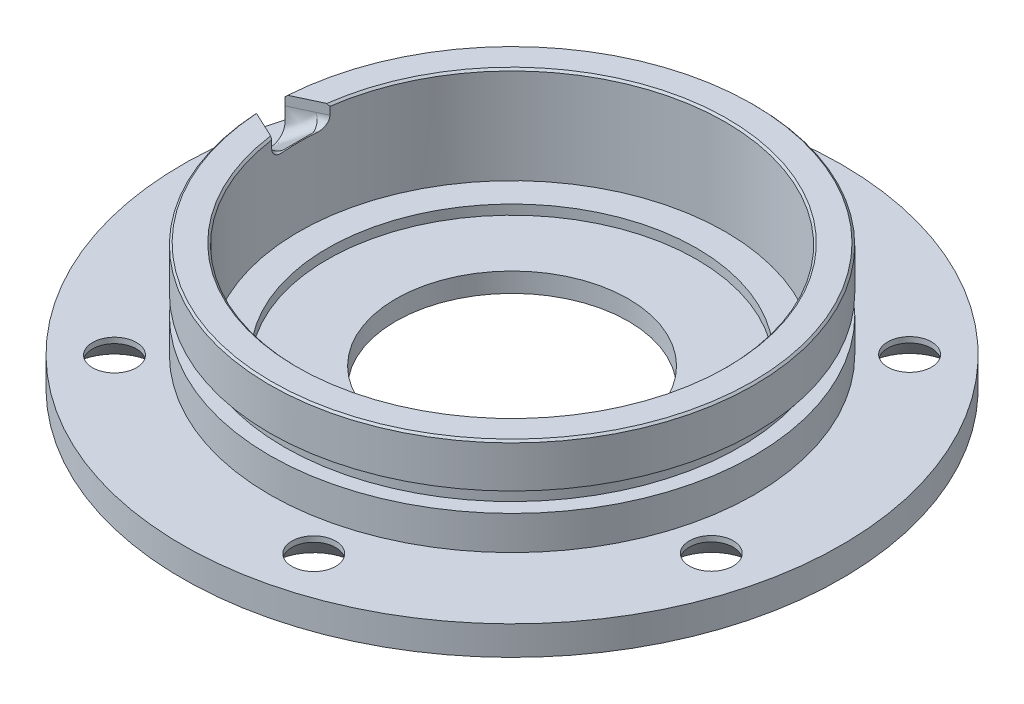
ISO-10303-21;
HEADER;
FILE_DESCRIPTION(('STEP AP214'),'2;1');
FILE_NAME('part.step','',(''),(''),'','','');
FILE_SCHEMA(('AUTOMOTIVE_DESIGN { 1 0 10303 214 1 1 1 1 }'));
ENDSEC;
DATA;
#1=APPLICATION_CONTEXT('core data for automotive mechanical design processes');
#2=APPLICATION_PROTOCOL_DEFINITION('international standard','automotive_design',2000,#1);
#3=PRODUCT_CONTEXT('',#1,'mechanical');
#4=PRODUCT('Part','Part','',(#3));
#5=PRODUCT_RELATED_PRODUCT_CATEGORY('part','',(#4));
#6=PRODUCT_DEFINITION_FORMATION('','',#4);
#7=PRODUCT_DEFINITION_CONTEXT('part definition',#1,'design');
#8=PRODUCT_DEFINITION('design','',#6,#7);
#9=PRODUCT_DEFINITION_SHAPE('','',#8);
#10=(LENGTH_UNIT() NAMED_UNIT(*) SI_UNIT(.MILLI.,.METRE.));
#11=(NAMED_UNIT(*) PLANE_ANGLE_UNIT() SI_UNIT($,.RADIAN.));
#12=(NAMED_UNIT(*) SI_UNIT($,.STERADIAN.) SOLID_ANGLE_UNIT());
#13=UNCERTAINTY_MEASURE_WITH_UNIT(LENGTH_MEASURE(1.E-05),#10,'distance_accuracy_value','');
#14=(GEOMETRIC_REPRESENTATION_CONTEXT(3) GLOBAL_UNCERTAINTY_ASSIGNED_CONTEXT((#13)) GLOBAL_UNIT_ASSIGNED_CONTEXT((#10,
#11,#12)) REPRESENTATION_CONTEXT('',''));
#15=CARTESIAN_POINT('',(0.,0.,0.));
#16=DIRECTION('',(0.,0.,1.));
#17=DIRECTION('',(1.,0.,0.));
#18=AXIS2_PLACEMENT_3D('',#15,#16,#17);
#19=CARTESIAN_POINT('',(-17.,-6.5,0.));
#20=DIRECTION('',(0.,1.,0.));
#21=DIRECTION('',(0.,0.,1.));
#22=AXIS2_PLACEMENT_3D('',#19,#20,#21);
#23=PLANE('',#22);
#24=CARTESIAN_POINT('',(3.77141398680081,-6.5,14.0009441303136));
#25=DIRECTION('',(0.,-1.,0.));
#26=DIRECTION('',(0.,0.,-1.));
#27=AXIS2_PLACEMENT_3D('',#24,#25,#26);
#28=CIRCLE('',#27,2.1844);
#29=CARTESIAN_POINT('',(3.77141398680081,-6.5,11.8165441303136));
#30=VERTEX_POINT('',#29);
#31=EDGE_CURVE('E850',#30,#30,#28,.T.);
#32=ORIENTED_EDGE('',*,*,#31,.F.);
#33=EDGE_LOOP('',(#32));
#34=FACE_BOUND('',#33,.T.);
#35=CARTESIAN_POINT('',(-14.0108802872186,-6.5,-3.73433174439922));
#36=DIRECTION('',(0.,-1.,0.));
#37=DIRECTION('',(0.,0.,-1.));
#38=AXIS2_PLACEMENT_3D('',#35,#36,#37);
#39=CIRCLE('',#38,2.1844);
#40=CARTESIAN_POINT('',(-14.0108802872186,-6.5,-5.91873174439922));
#41=VERTEX_POINT('',#40);
#42=EDGE_CURVE('E521',#41,#41,#39,.T.);
#43=ORIENTED_EDGE('',*,*,#42,.F.);
#44=EDGE_LOOP('',(#43));
#45=FACE_BOUND('',#44,.T.);
#46=CARTESIAN_POINT('',(-10.2394663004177,-6.5,10.2666123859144));
#47=DIRECTION('',(0.,-1.,0.));
#48=DIRECTION('',(0.,0.,-1.));
#49=AXIS2_PLACEMENT_3D('',#46,#47,#48);
#50=CIRCLE('',#49,2.1844);
#51=CARTESIAN_POINT('',(-10.2394663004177,-6.5,8.08221238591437));
#52=VERTEX_POINT('',#51);
#53=EDGE_CURVE('E528',#52,#52,#50,.T.);
#54=ORIENTED_EDGE('',*,*,#53,.F.);
#55=EDGE_LOOP('',(#54));
#56=FACE_BOUND('',#55,.T.);
#57=CARTESIAN_POINT('',(0.,-6.5,0.));
#58=DIRECTION('',(0.,-1.,0.));
#59=DIRECTION('',(0.,0.,-1.));
#60=AXIS2_PLACEMENT_3D('',#57,#58,#59);
#61=CIRCLE('',#60,6.);
#62=CARTESIAN_POINT('',(0.,-6.5,-6.));
#63=VERTEX_POINT('',#62);
#64=EDGE_CURVE('E453',#63,#63,#61,.T.);
#65=ORIENTED_EDGE('',*,*,#64,.F.);
#66=EDGE_LOOP('',(#65));
#67=FACE_BOUND('',#66,.T.);
#68=CARTESIAN_POINT('',(0.,-6.5,0.));
#69=DIRECTION('',(0.,-1.,0.));
#70=DIRECTION('',(0.,0.,-1.));
#71=AXIS2_PLACEMENT_3D('',#68,#69,#70);
#72=CIRCLE('',#71,17.);
#73=CARTESIAN_POINT('',(0.,-6.5,-17.));
#74=VERTEX_POINT('',#73);
#75=EDGE_CURVE('E450',#74,#74,#72,.T.);
#76=ORIENTED_EDGE('',*,*,#75,.T.);
#77=EDGE_LOOP('',(#76));
#78=FACE_BOUND('',#77,.T.);
#79=CARTESIAN_POINT('',(-3.77141398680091,-6.5,-14.0009441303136));
#80=DIRECTION('',(0.,-1.,0.));
#81=DIRECTION('',(0.,0.,-1.));
#82=AXIS2_PLACEMENT_3D('',#79,#80,#81);
#83=CIRCLE('',#82,2.1844);
#84=CARTESIAN_POINT('',(-3.77141398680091,-6.5,-16.1853441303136));
#85=VERTEX_POINT('',#84);
#86=EDGE_CURVE('E492',#85,#85,#83,.T.);
#87=ORIENTED_EDGE('',*,*,#86,.F.);
#88=EDGE_LOOP('',(#87));
#89=FACE_BOUND('',#88,.T.);
#90=CARTESIAN_POINT('',(10.2394663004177,-6.5,-10.2666123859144));
#91=DIRECTION('',(0.,-1.,0.));
#92=DIRECTION('',(0.,0.,-1.));
#93=AXIS2_PLACEMENT_3D('',#90,#91,#92);
#94=CIRCLE('',#93,2.1844);
#95=CARTESIAN_POINT('',(10.2394663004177,-6.5,-12.4510123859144));
#96=VERTEX_POINT('',#95);
#97=EDGE_CURVE('E496',#96,#96,#94,.T.);
#98=ORIENTED_EDGE('',*,*,#97,.F.);
#99=EDGE_LOOP('',(#98));
#100=FACE_BOUND('',#99,.T.);
#101=CARTESIAN_POINT('',(14.0108802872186,-6.5,3.73433174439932));
#102=DIRECTION('',(0.,-1.,0.));
#103=DIRECTION('',(0.,0.,-1.));
#104=AXIS2_PLACEMENT_3D('',#101,#102,#103);
#105=CIRCLE('',#104,2.1844);
#106=CARTESIAN_POINT('',(14.0108802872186,-6.5,1.54993174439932));
#107=VERTEX_POINT('',#106);
#108=EDGE_CURVE('E499',#107,#107,#105,.T.);
#109=ORIENTED_EDGE('',*,*,#108,.F.);
#110=EDGE_LOOP('',(#109));
#111=FACE_BOUND('',#110,.T.);
#112=ADVANCED_FACE('F123',(#34,#45,#56,#67,#78,#89,#100,#111),#23,.F.);
#113=CARTESIAN_POINT('',(-11.,-5.,0.));
#114=DIRECTION('',(0.,-1.,0.));
#115=DIRECTION('',(0.,0.,-1.));
#116=AXIS2_PLACEMENT_3D('',#113,#114,#115);
#117=PLANE('',#116);
#118=CARTESIAN_POINT('',(0.,-5.,0.));
#119=DIRECTION('',(0.,-1.,0.));
#120=DIRECTION('',(0.,0.,-1.));
#121=AXIS2_PLACEMENT_3D('',#118,#119,#120);
#122=CIRCLE('',#121,11.);
#123=CARTESIAN_POINT('',(0.,-5.,-11.));
#124=VERTEX_POINT('',#123);
#125=EDGE_CURVE('E429',#124,#124,#122,.T.);
#126=ORIENTED_EDGE('',*,*,#125,.F.);
#127=EDGE_LOOP('',(#126));
#128=FACE_BOUND('',#127,.T.);
#129=CARTESIAN_POINT('',(0.,-5.,0.));
#130=DIRECTION('',(0.,-1.,0.));
#131=DIRECTION('',(0.,0.,-1.));
#132=AXIS2_PLACEMENT_3D('',#129,#130,#131);
#133=CIRCLE('',#132,9.525);
#134=CARTESIAN_POINT('',(0.,-5.,-9.525));
#135=VERTEX_POINT('',#134);
#136=EDGE_CURVE('E347',#135,#135,#133,.T.);
#137=ORIENTED_EDGE('',*,*,#136,.T.);
#138=EDGE_LOOP('',(#137));
#139=FACE_BOUND('',#138,.T.);
#140=ADVANCED_FACE('F368',(#128,#139),#117,.F.);
#141=CARTESIAN_POINT('',(0.,0.,0.));
#142=DIRECTION('',(0.,-1.,0.));
#143=DIRECTION('',(0.,0.,-1.));
#144=AXIS2_PLACEMENT_3D('',#141,#142,#143);
#145=CYLINDRICAL_SURFACE('',#144,9.525);
#146=ORIENTED_EDGE('',*,*,#136,.F.);
#147=EDGE_LOOP('',(#146));
#148=FACE_BOUND('',#147,.T.);
#149=CARTESIAN_POINT('',(0.,-5.5,0.));
#150=DIRECTION('',(0.,-1.,0.));
#151=DIRECTION('',(0.,0.,-1.));
#152=AXIS2_PLACEMENT_3D('',#149,#150,#151);
#153=CIRCLE('',#152,9.525);
#154=CARTESIAN_POINT('',(0.,-5.5,-9.525));
#155=VERTEX_POINT('',#154);
#156=EDGE_CURVE('E459',#155,#155,#153,.T.);
#157=ORIENTED_EDGE('',*,*,#156,.T.);
#158=EDGE_LOOP('',(#157));
#159=FACE_BOUND('',#158,.T.);
#160=ADVANCED_FACE('F465',(#148,#159),#145,.F.);
#161=CARTESIAN_POINT('',(-9.525,-5.5,0.));
#162=DIRECTION('',(0.,-1.,0.));
#163=DIRECTION('',(0.,0.,-1.));
#164=AXIS2_PLACEMENT_3D('',#161,#162,#163);
#165=PLANE('',#164);
#166=ORIENTED_EDGE('',*,*,#156,.F.);
#167=EDGE_LOOP('',(#166));
#168=FACE_BOUND('',#167,.T.);
#169=CARTESIAN_POINT('',(0.,-5.5,0.));
#170=DIRECTION('',(0.,-1.,0.));
#171=DIRECTION('',(0.,0.,-1.));
#172=AXIS2_PLACEMENT_3D('',#169,#170,#171);
#173=CIRCLE('',#172,6.);
#174=CARTESIAN_POINT('',(0.,-5.5,-6.));
#175=VERTEX_POINT('',#174);
#176=EDGE_CURVE('E456',#175,#175,#173,.T.);
#177=ORIENTED_EDGE('',*,*,#176,.T.);
#178=EDGE_LOOP('',(#177));
#179=FACE_BOUND('',#178,.T.);
#180=ADVANCED_FACE('F468',(#168,#179),#165,.F.);
#181=CARTESIAN_POINT('',(0.,0.,0.));
#182=DIRECTION('',(0.,-1.,0.));
#183=DIRECTION('',(0.,0.,-1.));
#184=AXIS2_PLACEMENT_3D('',#181,#182,#183);
#185=CYLINDRICAL_SURFACE('',#184,6.);
#186=ORIENTED_EDGE('',*,*,#176,.F.);
#187=EDGE_LOOP('',(#186));
#188=FACE_BOUND('',#187,.T.);
#189=ORIENTED_EDGE('',*,*,#64,.T.);
#190=EDGE_LOOP('',(#189));
#191=FACE_BOUND('',#190,.T.);
#192=ADVANCED_FACE('F473',(#188,#191),#185,.F.);
#193=CARTESIAN_POINT('',(0.,0.,0.));
#194=DIRECTION('',(0.,-1.,0.));
#195=DIRECTION('',(0.,0.,-1.));
#196=AXIS2_PLACEMENT_3D('',#193,#194,#195);
#197=CYLINDRICAL_SURFACE('',#196,17.);
#198=ORIENTED_EDGE('',*,*,#75,.F.);
#199=EDGE_LOOP('',(#198));
#200=FACE_BOUND('',#199,.T.);
#201=CARTESIAN_POINT('',(0.,-5.,0.));
#202=DIRECTION('',(0.,-1.,0.));
#203=DIRECTION('',(0.,0.,-1.));
#204=AXIS2_PLACEMENT_3D('',#201,#202,#203);
#205=CIRCLE('',#204,17.);
#206=CARTESIAN_POINT('',(0.,-5.,-17.));
#207=VERTEX_POINT('',#206);
#208=EDGE_CURVE('E447',#207,#207,#205,.T.);
#209=ORIENTED_EDGE('',*,*,#208,.T.);
#210=EDGE_LOOP('',(#209));
#211=FACE_BOUND('',#210,.T.);
#212=ADVANCED_FACE('F479',(#200,#211),#197,.T.);
#213=CARTESIAN_POINT('',(-12.5,-5.,0.));
#214=DIRECTION('',(0.,-1.,0.));
#215=DIRECTION('',(0.,0.,-1.));
#216=AXIS2_PLACEMENT_3D('',#213,#214,#215);
#217=PLANE('',#216);
#218=CARTESIAN_POINT('',(3.77141398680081,-5.,14.0009441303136));
#219=DIRECTION('',(0.,-1.,0.));
#220=DIRECTION('',(0.,0.,-1.));
#221=AXIS2_PLACEMENT_3D('',#218,#219,#220);
#222=CIRCLE('',#221,1.1303);
#223=CARTESIAN_POINT('',(3.77141398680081,-5.,12.8706441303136));
#224=VERTEX_POINT('',#223);
#225=EDGE_CURVE('E128',#224,#224,#222,.T.);
#226=ORIENTED_EDGE('',*,*,#225,.T.);
#227=EDGE_LOOP('',(#226));
#228=FACE_BOUND('',#227,.T.);
#229=CARTESIAN_POINT('',(14.0108802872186,-5.,3.73433174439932));
#230=DIRECTION('',(0.,-1.,0.));
#231=DIRECTION('',(0.,0.,-1.));
#232=AXIS2_PLACEMENT_3D('',#229,#230,#231);
#233=CIRCLE('',#232,1.1303);
#234=CARTESIAN_POINT('',(14.0108802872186,-5.,2.60403174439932));
#235=VERTEX_POINT('',#234);
#236=EDGE_CURVE('E504',#235,#235,#233,.T.);
#237=ORIENTED_EDGE('',*,*,#236,.T.);
#238=EDGE_LOOP('',(#237));
#239=FACE_BOUND('',#238,.T.);
#240=CARTESIAN_POINT('',(10.2394663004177,-5.,-10.2666123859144));
#241=DIRECTION('',(0.,-1.,0.));
#242=DIRECTION('',(0.,0.,-1.));
#243=AXIS2_PLACEMENT_3D('',#240,#241,#242);
#244=CIRCLE('',#243,1.1303);
#245=CARTESIAN_POINT('',(10.2394663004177,-5.,-11.3969123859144));
#246=VERTEX_POINT('',#245);
#247=EDGE_CURVE('E515',#246,#246,#244,.T.);
#248=ORIENTED_EDGE('',*,*,#247,.T.);
#249=EDGE_LOOP('',(#248));
#250=FACE_BOUND('',#249,.T.);
#251=CARTESIAN_POINT('',(-3.77141398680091,-5.,-14.0009441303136));
#252=DIRECTION('',(0.,-1.,0.));
#253=DIRECTION('',(0.,0.,-1.));
#254=AXIS2_PLACEMENT_3D('',#251,#252,#253);
#255=CIRCLE('',#254,1.1303);
#256=CARTESIAN_POINT('',(-3.77141398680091,-5.,-15.1312441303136));
#257=VERTEX_POINT('',#256);
#258=EDGE_CURVE('E520',#257,#257,#255,.T.);
#259=ORIENTED_EDGE('',*,*,#258,.T.);
#260=EDGE_LOOP('',(#259));
#261=FACE_BOUND('',#260,.T.);
#262=CARTESIAN_POINT('',(-14.0108802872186,-5.,-3.73433174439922));
#263=DIRECTION('',(0.,-1.,0.));
#264=DIRECTION('',(0.,0.,-1.));
#265=AXIS2_PLACEMENT_3D('',#262,#263,#264);
#266=CIRCLE('',#265,1.1303);
#267=CARTESIAN_POINT('',(-14.0108802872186,-5.,-4.86463174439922));
#268=VERTEX_POINT('',#267);
#269=EDGE_CURVE('E527',#268,#268,#266,.T.);
#270=ORIENTED_EDGE('',*,*,#269,.T.);
#271=EDGE_LOOP('',(#270));
#272=FACE_BOUND('',#271,.T.);
#273=CARTESIAN_POINT('',(-10.2394663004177,-5.,10.2666123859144));
#274=DIRECTION('',(0.,-1.,0.));
#275=DIRECTION('',(0.,0.,-1.));
#276=AXIS2_PLACEMENT_3D('',#273,#274,#275);
#277=CIRCLE('',#276,1.1303);
#278=CARTESIAN_POINT('',(-10.2394663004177,-5.,9.13631238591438));
#279=VERTEX_POINT('',#278);
#280=EDGE_CURVE('E534',#279,#279,#277,.T.);
#281=ORIENTED_EDGE('',*,*,#280,.T.);
#282=EDGE_LOOP('',(#281));
#283=FACE_BOUND('',#282,.T.);
#284=ORIENTED_EDGE('',*,*,#208,.F.);
#285=EDGE_LOOP('',(#284));
#286=FACE_BOUND('',#285,.T.);
#287=CARTESIAN_POINT('',(0.,-5.,0.));
#288=DIRECTION('',(0.,-1.,0.));
#289=DIRECTION('',(0.,0.,-1.));
#290=AXIS2_PLACEMENT_3D('',#287,#288,#289);
#291=CIRCLE('',#290,12.5);
#292=CARTESIAN_POINT('',(0.,-5.,-12.5));
#293=VERTEX_POINT('',#292);
#294=EDGE_CURVE('E444',#293,#293,#291,.T.);
#295=ORIENTED_EDGE('',*,*,#294,.T.);
#296=EDGE_LOOP('',(#295));
#297=FACE_BOUND('',#296,.T.);
#298=ADVANCED_FACE('F566',(#228,#239,#250,#261,#272,#283,#286,#297),#217,.F.);
#299=CARTESIAN_POINT('',(0.,0.,0.));
#300=DIRECTION('',(0.,-1.,0.));
#301=DIRECTION('',(0.,0.,-1.));
#302=AXIS2_PLACEMENT_3D('',#299,#300,#301);
#303=CYLINDRICAL_SURFACE('',#302,12.5);
#304=ORIENTED_EDGE('',*,*,#294,.F.);
#305=EDGE_LOOP('',(#304));
#306=FACE_BOUND('',#305,.T.);
#307=CARTESIAN_POINT('',(0.,-3.25,0.));
#308=DIRECTION('',(0.,-1.,0.));
#309=DIRECTION('',(0.,0.,-1.));
#310=AXIS2_PLACEMENT_3D('',#307,#308,#309);
#311=CIRCLE('',#310,12.5);
#312=CARTESIAN_POINT('',(0.,-3.25,-12.5));
#313=VERTEX_POINT('',#312);
#314=EDGE_CURVE('E441',#313,#313,#311,.T.);
#315=ORIENTED_EDGE('',*,*,#314,.T.);
#316=EDGE_LOOP('',(#315));
#317=FACE_BOUND('',#316,.T.);
#318=ADVANCED_FACE('F685',(#306,#317),#303,.T.);
#319=CARTESIAN_POINT('',(-11.75,-3.25,0.));
#320=DIRECTION('',(0.,-1.,0.));
#321=DIRECTION('',(0.,0.,-1.));
#322=AXIS2_PLACEMENT_3D('',#319,#320,#321);
#323=PLANE('',#322);
#324=ORIENTED_EDGE('',*,*,#314,.F.);
#325=EDGE_LOOP('',(#324));
#326=FACE_BOUND('',#325,.T.);
#327=CARTESIAN_POINT('',(0.,-3.25,0.));
#328=DIRECTION('',(0.,-1.,0.));
#329=DIRECTION('',(0.,0.,-1.));
#330=AXIS2_PLACEMENT_3D('',#327,#328,#329);
#331=CIRCLE('',#330,11.75);
#332=CARTESIAN_POINT('',(0.,-3.25,-11.75));
#333=VERTEX_POINT('',#332);
#334=EDGE_CURVE('E438',#333,#333,#331,.T.);
#335=ORIENTED_EDGE('',*,*,#334,.T.);
#336=EDGE_LOOP('',(#335));
#337=FACE_BOUND('',#336,.T.);
#338=ADVANCED_FACE('F678',(#326,#337),#323,.F.);
#339=CARTESIAN_POINT('',(0.,0.,0.));
#340=DIRECTION('',(0.,-1.,0.));
#341=DIRECTION('',(0.,0.,-1.));
#342=AXIS2_PLACEMENT_3D('',#339,#340,#341);
#343=CYLINDRICAL_SURFACE('',#342,11.75);
#344=ORIENTED_EDGE('',*,*,#334,.F.);
#345=EDGE_LOOP('',(#344));
#346=FACE_BOUND('',#345,.T.);
#347=CARTESIAN_POINT('',(0.,-2.25,0.));
#348=DIRECTION('',(0.,-1.,0.));
#349=DIRECTION('',(0.,0.,-1.));
#350=AXIS2_PLACEMENT_3D('',#347,#348,#349);
#351=CIRCLE('',#350,11.75);
#352=CARTESIAN_POINT('',(0.,-2.25,-11.75));
#353=VERTEX_POINT('',#352);
#354=EDGE_CURVE('E435',#353,#353,#351,.T.);
#355=ORIENTED_EDGE('',*,*,#354,.T.);
#356=EDGE_LOOP('',(#355));
#357=FACE_BOUND('',#356,.T.);
#358=ADVANCED_FACE('F671',(#346,#357),#343,.T.);
#359=CARTESIAN_POINT('',(-12.5,-2.25,0.));
#360=DIRECTION('',(0.,1.,0.));
#361=DIRECTION('',(0.,0.,1.));
#362=AXIS2_PLACEMENT_3D('',#359,#360,#361);
#363=PLANE('',#362);
#364=ORIENTED_EDGE('',*,*,#354,.F.);
#365=EDGE_LOOP('',(#364));
#366=FACE_BOUND('',#365,.T.);
#367=CARTESIAN_POINT('',(0.,-2.25,0.));
#368=DIRECTION('',(0.,-1.,0.));
#369=DIRECTION('',(0.,0.,-1.));
#370=AXIS2_PLACEMENT_3D('',#367,#368,#369);
#371=CIRCLE('',#370,12.5);
#372=CARTESIAN_POINT('',(0.,-2.25,-12.5));
#373=VERTEX_POINT('',#372);
#374=EDGE_CURVE('E432',#373,#373,#371,.T.);
#375=ORIENTED_EDGE('',*,*,#374,.T.);
#376=EDGE_LOOP('',(#375));
#377=FACE_BOUND('',#376,.T.);
#378=ADVANCED_FACE('F254',(#366,#377),#363,.F.);
#379=CARTESIAN_POINT('',(0.,0.,0.));
#380=DIRECTION('',(0.,-1.,0.));
#381=DIRECTION('',(0.,0.,-1.));
#382=AXIS2_PLACEMENT_3D('',#379,#380,#381);
#383=CYLINDRICAL_SURFACE('',#382,12.5);
#384=ORIENTED_EDGE('',*,*,#374,.F.);
#385=EDGE_LOOP('',(#384));
#386=FACE_BOUND('',#385,.T.);
#387=DIRECTION('',(0.,-1.,0.));
#388=VECTOR('',#387,1.);
#389=CARTESIAN_POINT('',(-12.4768230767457,0.,-0.760845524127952));
#390=LINE('',#389,#388);
#391=CARTESIAN_POINT('',(-12.4768230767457,-0.5,-0.76084552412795));
#392=VERTEX_POINT('',#391);
#393=CARTESIAN_POINT('',(-12.4768230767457,-0.0999999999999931,-0.760845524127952));
#394=VERTEX_POINT('',#393);
#395=EDGE_CURVE('E427',#392,#394,#390,.F.);
#396=ORIENTED_EDGE('',*,*,#395,.T.);
#397=CARTESIAN_POINT('',(0.,-0.0999999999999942,0.));
#398=DIRECTION('',(0.,-1.,0.));
#399=DIRECTION('',(0.,0.,-1.));
#400=AXIS2_PLACEMENT_3D('',#397,#398,#399);
#401=CIRCLE('',#400,12.5);
#402=CARTESIAN_POINT('',(-12.4768230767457,-0.0999999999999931,0.760845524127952));
#403=VERTEX_POINT('',#402);
#404=EDGE_CURVE('E411',#394,#403,#401,.T.);
#405=ORIENTED_EDGE('',*,*,#404,.T.);
#406=DIRECTION('',(0.,-1.,0.));
#407=VECTOR('',#406,1.);
#408=CARTESIAN_POINT('',(-12.4768230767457,0.,0.760845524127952));
#409=LINE('',#408,#407);
#410=CARTESIAN_POINT('',(-12.4768230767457,-1.24401591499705,0.760845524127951));
#411=VERTEX_POINT('',#410);
#412=EDGE_CURVE('E424',#403,#411,#409,.T.);
#413=ORIENTED_EDGE('',*,*,#412,.T.);
#414=CARTESIAN_POINT('',(-12.4768230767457,-1.24401591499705,0.760845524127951));
#415=CARTESIAN_POINT('',(-12.476823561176,-1.26311623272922,0.760833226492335));
#416=CARTESIAN_POINT('',(-12.4768721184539,-1.28220991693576,0.760041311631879));
#417=CARTESIAN_POINT('',(-12.477058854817,-1.32027685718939,0.756971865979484));
#418=CARTESIAN_POINT('',(-12.477197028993,-1.33925011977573,0.754694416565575));
#419=CARTESIAN_POINT('',(-12.4775556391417,-1.37688327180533,0.748741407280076));
#420=CARTESIAN_POINT('',(-12.4777756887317,-1.39554420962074,0.745072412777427));
#421=CARTESIAN_POINT('',(-12.4782935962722,-1.4325403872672,0.736347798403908));
#422=CARTESIAN_POINT('',(-12.4785914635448,-1.45087558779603,0.731292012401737));
#423=CARTESIAN_POINT('',(-12.4792925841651,-1.48887999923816,0.719233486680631));
#424=CARTESIAN_POINT('',(-12.4797032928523,-1.50850441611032,0.712088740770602));
#425=CARTESIAN_POINT('',(-12.4806065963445,-1.54703300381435,0.696076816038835));
#426=CARTESIAN_POINT('',(-12.4810991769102,-1.56593729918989,0.687209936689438));
#427=CARTESIAN_POINT('',(-12.4821497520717,-1.6029346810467,0.667855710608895));
#428=CARTESIAN_POINT('',(-12.4827078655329,-1.62102620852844,0.657365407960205));
#429=CARTESIAN_POINT('',(-12.4838651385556,-1.65634118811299,0.635009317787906));
#430=CARTESIAN_POINT('',(-12.4844643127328,-1.673564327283,0.623143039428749));
#431=CARTESIAN_POINT('',(-12.4856908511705,-1.70721054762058,0.598065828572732));
#432=CARTESIAN_POINT('',(-12.4863183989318,-1.72362633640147,0.584845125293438));
#433=CARTESIAN_POINT('',(-12.4875816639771,-1.75542596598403,0.557221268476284));
#434=CARTESIAN_POINT('',(-12.4882173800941,-1.77080995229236,0.542818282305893));
#435=CARTESIAN_POINT('',(-12.4894833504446,-1.80040202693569,0.512864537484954));
#436=CARTESIAN_POINT('',(-12.4901136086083,-1.81461103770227,0.497314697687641));
#437=CARTESIAN_POINT('',(-12.4913567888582,-1.84161867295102,0.465045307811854));
#438=CARTESIAN_POINT('',(-12.4919697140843,-1.85441755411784,0.448325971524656));
#439=CARTESIAN_POINT('',(-12.493821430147,-1.89185398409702,0.394643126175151));
#440=CARTESIAN_POINT('',(-12.4950005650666,-1.91388141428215,0.355789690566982));
#441=CARTESIAN_POINT('',(-12.4965319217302,-1.94142965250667,0.295134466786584));
#442=CARTESIAN_POINT('',(-12.4970029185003,-1.94969851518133,0.274513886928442));
#443=CARTESIAN_POINT('',(-12.4978521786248,-1.96448621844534,0.232653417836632));
#444=CARTESIAN_POINT('',(-12.4982304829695,-1.97100583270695,0.211413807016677));
#445=CARTESIAN_POINT('',(-12.4988634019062,-1.98184163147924,0.16976722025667));
#446=CARTESIAN_POINT('',(-12.4991241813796,-1.98626846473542,0.14938911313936));
#447=CARTESIAN_POINT('',(-12.4995472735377,-1.99332293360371,0.108342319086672));
#448=CARTESIAN_POINT('',(-12.4997096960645,-1.9959525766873,0.0876739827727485));
#449=CARTESIAN_POINT('',(-12.499848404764,-1.99821926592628,0.0617791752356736));
#450=CARTESIAN_POINT('',(-12.499872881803,-1.99862077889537,0.0566104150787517));
#451=CARTESIAN_POINT('',(-12.4999154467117,-1.99930107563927,0.0462658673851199));
#452=CARTESIAN_POINT('',(-12.4999335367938,-1.99957990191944,0.0410900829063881));
#453=CARTESIAN_POINT('',(-12.4999558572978,-1.9998607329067,0.0333208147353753));
#454=CARTESIAN_POINT('',(-12.4999624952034,-1.99993144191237,0.0307300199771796));
#455=CARTESIAN_POINT('',(-12.4999741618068,-1.99999563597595,0.0255473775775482));
#456=CARTESIAN_POINT('',(-12.4999791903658,-1.99998911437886,0.0229555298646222));
#457=CARTESIAN_POINT('',(-12.4999876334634,-1.99998800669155,0.0177729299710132));
#458=CARTESIAN_POINT('',(-12.4999910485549,-1.99999341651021,0.015182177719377));
#459=CARTESIAN_POINT('',(-12.4999943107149,-1.99999617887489,0.0119436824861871));
#460=CARTESIAN_POINT('',(-12.4999949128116,-1.99999653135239,0.0112959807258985));
#461=CARTESIAN_POINT('',(-12.499996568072,-1.99999755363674,0.00935287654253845));
#462=CARTESIAN_POINT('',(-12.4999974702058,-1.99999818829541,0.00805747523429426));
#463=CARTESIAN_POINT('',(-12.4999995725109,-1.9999998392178,0.00417127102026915));
#464=CARTESIAN_POINT('',(-12.5000001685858,-2.00000060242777,0.00158046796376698));
#465=CARTESIAN_POINT('',(-12.4999995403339,-1.99999871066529,-0.00619195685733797));
#466=CARTESIAN_POINT('',(-12.4999958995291,-1.99999187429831,-0.0113735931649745));
#467=CARTESIAN_POINT('',(-12.499985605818,-1.99999272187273,-0.0191459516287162));
#468=CARTESIAN_POINT('',(-12.4999813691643,-1.99999485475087,-0.0217367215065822));
#469=CARTESIAN_POINT('',(-12.4999712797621,-1.99997248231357,-0.0269207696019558));
#470=CARTESIAN_POINT('',(-12.4999654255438,-1.99994795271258,-0.0295140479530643));
#471=CARTESIAN_POINT('',(-12.499952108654,-1.99982372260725,-0.0346987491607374));
#472=CARTESIAN_POINT('',(-12.4999446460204,-1.99972402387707,-0.0372901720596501));
#473=CARTESIAN_POINT('',(-12.4999198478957,-1.99936882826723,-0.0450627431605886));
#474=CARTESIAN_POINT('',(-12.4999001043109,-1.99905725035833,-0.0502411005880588));
#475=CARTESIAN_POINT('',(-12.4998311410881,-1.99794665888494,-0.0657965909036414));
#476=CARTESIAN_POINT('',(-12.4997722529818,-1.99697265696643,-0.0761613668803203));
#477=CARTESIAN_POINT('',(-12.4996291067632,-1.99462889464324,-0.0968463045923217));
#478=CARTESIAN_POINT('',(-12.4995448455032,-1.99325908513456,-0.107166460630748));
#479=CARTESIAN_POINT('',(-12.499254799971,-1.98846817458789,-0.138031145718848));
#480=CARTESIAN_POINT('',(-12.499011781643,-1.98436599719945,-0.158473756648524));
#481=CARTESIAN_POINT('',(-12.4984291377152,-1.97441893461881,-0.199223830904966));
#482=CARTESIAN_POINT('',(-12.4980882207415,-1.96855070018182,-0.219525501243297));
#483=CARTESIAN_POINT('',(-12.4973202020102,-1.95523851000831,-0.25959638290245));
#484=CARTESIAN_POINT('',(-12.4968930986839,-1.9477945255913,-0.279365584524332));
#485=CARTESIAN_POINT('',(-12.4955000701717,-1.9230111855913,-0.337603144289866));
#486=CARTESIAN_POINT('',(-12.4944213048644,-1.90320269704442,-0.375075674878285));
#487=CARTESIAN_POINT('',(-12.4926738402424,-1.86877500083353,-0.428278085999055));
#488=CARTESIAN_POINT('',(-12.4920678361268,-1.85647032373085,-0.445557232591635));
#489=CARTESIAN_POINT('',(-12.4908318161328,-1.83036663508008,-0.478956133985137));
#490=CARTESIAN_POINT('',(-12.4902017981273,-1.81656749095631,-0.495075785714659));
#491=CARTESIAN_POINT('',(-12.488929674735,-1.78763920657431,-0.52619345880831));
#492=CARTESIAN_POINT('',(-12.4882875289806,-1.77250459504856,-0.541186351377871));
#493=CARTESIAN_POINT('',(-12.4870061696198,-1.7411381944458,-0.569986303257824));
#494=CARTESIAN_POINT('',(-12.4863669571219,-1.72490602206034,-0.583792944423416));
#495=CARTESIAN_POINT('',(-12.4850900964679,-1.69100202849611,-0.610498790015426));
#496=CARTESIAN_POINT('',(-12.4844529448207,-1.67330335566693,-0.623363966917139));
#497=CARTESIAN_POINT('',(-12.483217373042,-1.63694408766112,-0.647635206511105));
#498=CARTESIAN_POINT('',(-12.4826189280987,-1.61828412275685,-0.659042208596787));
#499=CARTESIAN_POINT('',(-12.4814900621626,-1.58019657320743,-0.68008524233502));
#500=CARTESIAN_POINT('',(-12.4809590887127,-1.56077719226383,-0.689735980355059));
#501=CARTESIAN_POINT('',(-12.4799828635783,-1.52109824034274,-0.707180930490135));
#502=CARTESIAN_POINT('',(-12.4795376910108,-1.5008379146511,-0.714973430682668));
#503=CARTESIAN_POINT('',(-12.4787477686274,-1.46008152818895,-0.728628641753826));
#504=CARTESIAN_POINT('',(-12.4784013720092,-1.43959608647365,-0.734523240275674));
#505=CARTESIAN_POINT('',(-12.4778062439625,-1.39823472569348,-0.744564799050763));
#506=CARTESIAN_POINT('',(-12.4775573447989,-1.37735954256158,-0.748714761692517));
#507=CARTESIAN_POINT('',(-12.4772605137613,-1.34574215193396,-0.753639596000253));
#508=CARTESIAN_POINT('',(-12.4771740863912,-1.33509832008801,-0.755068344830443));
#509=CARTESIAN_POINT('',(-12.4770288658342,-1.31376347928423,-0.757464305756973));
#510=CARTESIAN_POINT('',(-12.476970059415,-1.3030724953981,-0.758431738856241));
#511=CARTESIAN_POINT('',(-12.4768801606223,-1.28163570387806,-0.75990919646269));
#512=CARTESIAN_POINT('',(-12.4768491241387,-1.27088982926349,-0.76041829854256));
#513=CARTESIAN_POINT('',(-12.4768201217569,-1.24938317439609,-0.760894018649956));
#514=CARTESIAN_POINT('',(-12.4768221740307,-1.23862238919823,-0.760860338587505));
#515=CARTESIAN_POINT('',(-12.4768243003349,-1.21327798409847,-0.760825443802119));
#516=CARTESIAN_POINT('',(-12.4768234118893,-1.19869512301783,-0.760840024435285));
#517=CARTESIAN_POINT('',(-12.4768227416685,-1.16952930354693,-0.760851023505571));
#518=CARTESIAN_POINT('',(-12.4768229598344,-1.15494634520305,-0.760847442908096));
#519=CARTESIAN_POINT('',(-12.4768233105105,-1.11120493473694,-0.760841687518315));
#520=CARTESIAN_POINT('',(-12.4768231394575,-1.082046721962,-0.760844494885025));
#521=CARTESIAN_POINT('',(-12.4768230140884,-1.0237554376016,-0.760846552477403));
#522=CARTESIAN_POINT('',(-12.4768230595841,-0.994622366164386,-0.760845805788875));
#523=CARTESIAN_POINT('',(-12.4768230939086,-0.936354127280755,-0.760845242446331));
#524=CARTESIAN_POINT('',(-12.4768230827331,-0.90721895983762,-0.760845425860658));
#525=CARTESIAN_POINT('',(-12.4768230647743,-0.819830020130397,-0.760845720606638));
#526=CARTESIAN_POINT('',(-12.4768230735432,-0.761576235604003,-0.760845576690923));
#527=CARTESIAN_POINT('',(-12.4768230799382,-0.645257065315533,-0.76084547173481));
#528=CARTESIAN_POINT('',(-12.4768230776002,-0.587191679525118,-0.760845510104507));
#529=CARTESIAN_POINT('',(-12.476823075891,-0.471046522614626,-0.760845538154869));
#530=CARTESIAN_POINT('',(-12.4768230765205,-0.41296675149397,-0.760845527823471));
#531=CARTESIAN_POINT('',(-12.4768230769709,-0.296805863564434,-0.760845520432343));
#532=CARTESIAN_POINT('',(-12.4768230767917,-0.238724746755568,-0.760845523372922));
#533=CARTESIAN_POINT('',(-12.4768230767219,-0.150551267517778,-0.760845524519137));
#534=CARTESIAN_POINT('',(-12.4768230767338,-0.120458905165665,-0.760845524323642));
#535=CARTESIAN_POINT('',(-12.4768230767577,-0.0602443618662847,-0.760845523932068));
#536=CARTESIAN_POINT('',(-12.4768230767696,-0.0301221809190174,-0.76084552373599));
#537=CARTESIAN_POINT('',(-12.4768230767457,0.,-0.760845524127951));
#538=B_SPLINE_CURVE_WITH_KNOTS('',3,(#414,#415,#416,#417,#418,#419,#420,#421,#422,#423,#424,
#425,#426,#427,#428,#429,#430,#431,#432,#433,#434,#435,#436,#437,#438,#439,#440,#441,#442,#443,
#444,#445,#446,#447,#448,#449,#450,#451,#452,#453,#454,#455,#456,#457,#458,#459,#460,#461,#462,
#463,#464,#465,#466,#467,#468,#469,#470,#471,#472,#473,#474,#475,#476,#477,#478,#479,#480,#481,
#482,#483,#484,#485,#486,#487,#488,#489,#490,#491,#492,#493,#494,#495,#496,#497,#498,#499,#500,
#501,#502,#503,#504,#505,#506,#507,#508,#509,#510,#511,#512,#513,#514,#515,#516,#517,#518,#519,
#520,#521,#522,#523,#524,#525,#526,#527,#528,#529,#530,#531,#532,#533,#534,#535,#536,#537),
.UNSPECIFIED.,.F.,.F.,(4,2,2,2,2,2,2,2,2,2,2,2,2,2,2,2,2,2,2,2,2,2,2,2,2,2,2,2,2,2,2,2,2,2,2,2,
2,2,2,2,2,2,2,2,2,2,2,2,2,2,2,2,2,2,2,2,2,2,2,2,2,4),(0.,0.0572759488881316,0.114548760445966,
0.171554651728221,0.228567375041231,0.291153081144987,0.353727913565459,0.416418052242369,
0.479130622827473,0.542332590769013,0.605525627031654,0.668668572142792,0.73180000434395,
0.864936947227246,0.931544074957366,0.998121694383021,1.06061444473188,1.12303727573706,
1.13859020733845,1.1541377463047,1.16191215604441,1.16968723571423,1.17745964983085,
1.17940275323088,1.18328896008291,1.19106137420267,1.20660620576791,1.2143786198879,
1.2221581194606,1.22993743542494,1.24549934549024,1.27672142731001,1.30794738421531,
1.37041767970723,1.43375317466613,1.49708982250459,1.6235367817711,1.68713325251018,
1.75073536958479,1.81461136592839,1.87850978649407,1.94411259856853,2.00967293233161,
2.07465611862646,2.13969894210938,2.20358375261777,2.2673581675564,2.29956874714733,
2.33176388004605,2.36402366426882,2.39630116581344,2.44005185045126,2.4838002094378,
2.57127525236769,2.65867435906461,2.74607988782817,2.92084122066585,3.09503738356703,
3.26927669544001,3.44352004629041,3.53379713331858,3.62416367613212),.UNSPECIFIED.);
#539=CARTESIAN_POINT('',(-12.4999977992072,-1.99999848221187,0.0102431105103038));
#540=VERTEX_POINT('',#539);
#541=EDGE_CURVE('E224',#411,#540,#538,.T.);
#542=ORIENTED_EDGE('',*,*,#541,.T.);
#543=DIRECTION('',(0.,0.,1.));
#544=VECTOR('',#543,1.);
#545=CARTESIAN_POINT('',(-12.5,-2.,-0.0100000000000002));
#546=LINE('',#545,#544);
#547=CARTESIAN_POINT('',(-12.4999999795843,-1.99999998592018,-0.000757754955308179));
#548=VERTEX_POINT('',#547);
#549=EDGE_CURVE('E230',#548,#540,#546,.T.);
#550=ORIENTED_EDGE('',*,*,#549,.F.);
#551=CARTESIAN_POINT('',(-12.5,-2.,-0.0100000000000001));
#552=VERTEX_POINT('',#551);
#553=EDGE_CURVE('E216',#552,#548,#546,.T.);
#554=ORIENTED_EDGE('',*,*,#553,.F.);
#555=EDGE_CURVE('E213',#552,#392,#538,.T.);
#556=ORIENTED_EDGE('',*,*,#555,.T.);
#557=EDGE_LOOP('',(#396,#405,#413,#542,#550,#554,#556));
#558=FACE_BOUND('',#557,.T.);
#559=ADVANCED_FACE('F228',(#386,#558),#383,.T.);
#560=CARTESIAN_POINT('',(-12.5,0.,0.));
#561=DIRECTION('',(0.,-1.,0.));
#562=DIRECTION('',(0.,0.,-1.));
#563=AXIS2_PLACEMENT_3D('',#560,#561,#562);
#564=PLANE('',#563);
#565=DIRECTION('',(0.905738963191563,0.,0.423835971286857));
#566=VECTOR('',#565,1.);
#567=CARTESIAN_POINT('',(-12.5,0.,0.75));
#568=LINE('',#567,#566);
#569=CARTESIAN_POINT('',(-12.3735709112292,0.,0.809161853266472));
#570=VERTEX_POINT('',#569);
#571=CARTESIAN_POINT('',(-11.0049370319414,0.,1.4496071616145));
#572=VERTEX_POINT('',#571);
#573=EDGE_CURVE('E412',#570,#572,#568,.T.);
#574=ORIENTED_EDGE('',*,*,#573,.F.);
#575=CARTESIAN_POINT('',(0.,0.,0.));
#576=DIRECTION('',(0.,-1.,0.));
#577=DIRECTION('',(0.,0.,-1.));
#578=AXIS2_PLACEMENT_3D('',#575,#576,#577);
#579=CIRCLE('',#578,12.4);
#580=CARTESIAN_POINT('',(-12.3735709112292,0.,-0.809161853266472));
#581=VERTEX_POINT('',#580);
#582=EDGE_CURVE('E147',#570,#581,#579,.F.);
#583=ORIENTED_EDGE('',*,*,#582,.T.);
#584=DIRECTION('',(-0.905738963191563,0.,0.423835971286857));
#585=VECTOR('',#584,1.);
#586=CARTESIAN_POINT('',(-12.5,0.,-0.75));
#587=LINE('',#586,#585);
#588=CARTESIAN_POINT('',(-11.0049370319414,0.,-1.4496071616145));
#589=VERTEX_POINT('',#588);
#590=EDGE_CURVE('E417',#589,#581,#587,.T.);
#591=ORIENTED_EDGE('',*,*,#590,.F.);
#592=CARTESIAN_POINT('',(0.,0.,0.));
#593=DIRECTION('',(0.,-1.,0.));
#594=DIRECTION('',(0.,0.,-1.));
#595=AXIS2_PLACEMENT_3D('',#592,#593,#594);
#596=CIRCLE('',#595,11.1);
#597=EDGE_CURVE('E545',#589,#572,#596,.T.);
#598=ORIENTED_EDGE('',*,*,#597,.T.);
#599=EDGE_LOOP('',(#574,#583,#591,#598));
#600=FACE_BOUND('',#599,.T.);
#601=ADVANCED_FACE('F253',(#600),#564,.F.);
#602=CARTESIAN_POINT('',(0.,0.,0.));
#603=DIRECTION('',(0.,-1.,0.));
#604=DIRECTION('',(0.,0.,-1.));
#605=AXIS2_PLACEMENT_3D('',#602,#603,#604);
#606=CYLINDRICAL_SURFACE('',#605,11.);
#607=DIRECTION('',(0.,1.,0.));
#608=VECTOR('',#607,1.);
#609=CARTESIAN_POINT('',(-10.8972473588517,-1.,1.5));
#610=LINE('',#609,#608);
#611=CARTESIAN_POINT('',(-10.8972473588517,-0.5,1.5));
#612=VERTEX_POINT('',#611);
#613=CARTESIAN_POINT('',(-10.8972473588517,-0.10000000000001,1.5));
#614=VERTEX_POINT('',#613);
#615=EDGE_CURVE('E416',#612,#614,#610,.T.);
#616=ORIENTED_EDGE('',*,*,#615,.T.);
#617=CARTESIAN_POINT('',(0.,-0.10000000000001,0.));
#618=DIRECTION('',(0.,-1.,0.));
#619=DIRECTION('',(0.,0.,-1.));
#620=AXIS2_PLACEMENT_3D('',#617,#618,#619);
#621=CIRCLE('',#620,11.);
#622=CARTESIAN_POINT('',(-10.8972473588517,-0.100000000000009,-1.5));
#623=VERTEX_POINT('',#622);
#624=EDGE_CURVE('E12',#614,#623,#621,.F.);
#625=ORIENTED_EDGE('',*,*,#624,.T.);
#626=DIRECTION('',(0.,1.,0.));
#627=VECTOR('',#626,1.);
#628=CARTESIAN_POINT('',(-10.8972473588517,-1.,-1.5));
#629=LINE('',#628,#627);
#630=CARTESIAN_POINT('',(-10.8972473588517,-0.5,-1.5));
#631=VERTEX_POINT('',#630);
#632=EDGE_CURVE('E422',#631,#623,#629,.T.);
#633=ORIENTED_EDGE('',*,*,#632,.F.);
#634=CARTESIAN_POINT('',(-10.8972473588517,-0.5,-1.5));
#635=CARTESIAN_POINT('',(-10.8972391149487,-0.525013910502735,-1.50004166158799));
#636=CARTESIAN_POINT('',(-10.8975518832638,-0.549992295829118,-1.49778784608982));
#637=CARTESIAN_POINT('',(-10.8987527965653,-0.599050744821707,-1.48903356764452));
#638=CARTESIAN_POINT('',(-10.8996379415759,-0.62313480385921,-1.48255524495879));
#639=CARTESIAN_POINT('',(-10.9019167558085,-0.669822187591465,-1.46570064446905));
#640=CARTESIAN_POINT('',(-10.9033097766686,-0.692427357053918,-1.45532933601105));
#641=CARTESIAN_POINT('',(-10.906505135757,-0.735725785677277,-1.43118647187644));
#642=CARTESIAN_POINT('',(-10.9083079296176,-0.756416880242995,-1.41741112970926));
#643=CARTESIAN_POINT('',(-10.912341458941,-0.796781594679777,-1.38602623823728));
#644=CARTESIAN_POINT('',(-10.9145921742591,-0.816305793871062,-1.36822797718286));
#645=CARTESIAN_POINT('',(-10.9193144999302,-0.852550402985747,-1.33001577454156));
#646=CARTESIAN_POINT('',(-10.9217861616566,-0.869270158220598,-1.30960122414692));
#647=CARTESIAN_POINT('',(-10.9272314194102,-0.902115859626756,-1.26342055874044));
#648=CARTESIAN_POINT('',(-10.9302239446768,-0.91775939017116,-1.23731356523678));
#649=CARTESIAN_POINT('',(-10.9362279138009,-0.945054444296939,-1.18307547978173));
#650=CARTESIAN_POINT('',(-10.9392393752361,-0.956701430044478,-1.15494213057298));
#651=CARTESIAN_POINT('',(-10.945652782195,-0.97749046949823,-1.09261525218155));
#652=CARTESIAN_POINT('',(-10.9490385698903,-0.98591695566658,-1.05818031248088));
#653=CARTESIAN_POINT('',(-10.9555578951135,-0.997167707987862,-0.988439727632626));
#654=CARTESIAN_POINT('',(-10.9586918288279,-1.00000094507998,-0.953135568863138));
#655=CARTESIAN_POINT('',(-10.9616415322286,-1.,-0.917831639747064));
#656=B_SPLINE_CURVE_WITH_KNOTS('',3,(#634,#635,#636,#637,#638,#639,#640,#641,#642,#643,#644,
#645,#646,#647,#648,#649,#650,#651,#652,#653,#654,#655),.UNSPECIFIED.,.F.,.F.,(4,2,2,2,2,2,2,2,
2,2,4),(0.,0.0748824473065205,0.149375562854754,0.223773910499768,0.298255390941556,
0.377494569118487,0.456752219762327,0.548138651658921,0.639628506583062,0.745999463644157,
0.852199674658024),.UNSPECIFIED.);
#657=CARTESIAN_POINT('',(-10.9616415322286,-1.,-0.917831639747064));
#658=VERTEX_POINT('',#657);
#659=EDGE_CURVE('E354',#631,#658,#656,.T.);
#660=ORIENTED_EDGE('',*,*,#659,.T.);
#661=CARTESIAN_POINT('',(0.,-1.,0.));
#662=DIRECTION('',(0.,-1.,0.));
#663=DIRECTION('',(0.,0.,-1.));
#664=AXIS2_PLACEMENT_3D('',#661,#662,#663);
#665=CIRCLE('',#664,11.);
#666=CARTESIAN_POINT('',(-10.9616415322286,-1.,0.917831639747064));
#667=VERTEX_POINT('',#666);
#668=EDGE_CURVE('E343',#658,#667,#665,.F.);
#669=ORIENTED_EDGE('',*,*,#668,.T.);
#670=CARTESIAN_POINT('',(-10.9616415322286,-1.,0.917831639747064));
#671=CARTESIAN_POINT('',(-10.9581025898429,-1.00000322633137,0.960255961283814));
#672=CARTESIAN_POINT('',(-10.9542879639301,-0.995908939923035,1.00269792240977));
#673=CARTESIAN_POINT('',(-10.9463152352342,-0.979642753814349,1.08622014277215));
#674=CARTESIAN_POINT('',(-10.9421553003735,-0.967424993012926,1.12729127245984));
#675=CARTESIAN_POINT('',(-10.9342870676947,-0.937119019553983,1.20107492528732));
#676=CARTESIAN_POINT('',(-10.9305896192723,-0.919989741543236,1.2341826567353));
#677=CARTESIAN_POINT('',(-10.9233645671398,-0.879874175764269,1.29656554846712));
#678=CARTESIAN_POINT('',(-10.9198364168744,-0.856908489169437,1.32585365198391));
#679=CARTESIAN_POINT('',(-10.9140703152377,-0.811996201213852,1.37239766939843));
#680=CARTESIAN_POINT('',(-10.91173204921,-0.791267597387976,1.39082148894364));
#681=CARTESIAN_POINT('',(-10.9074471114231,-0.74700458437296,1.42403565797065));
#682=CARTESIAN_POINT('',(-10.9055004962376,-0.723469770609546,1.43882548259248));
#683=CARTESIAN_POINT('',(-10.9021363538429,-0.673929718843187,1.46409977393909));
#684=CARTESIAN_POINT('',(-10.9007226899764,-0.647908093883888,1.47455285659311));
#685=CARTESIAN_POINT('',(-10.8985799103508,-0.594350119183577,1.49030906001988));
#686=CARTESIAN_POINT('',(-10.8978489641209,-0.566818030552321,1.49562595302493));
#687=CARTESIAN_POINT('',(-10.897412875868,-0.532580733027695,1.49879699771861));
#688=CARTESIAN_POINT('',(-10.8973508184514,-0.52606845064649,1.4992481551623));
#689=CARTESIAN_POINT('',(-10.8972681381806,-0.51303841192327,1.49984913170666));
#690=CARTESIAN_POINT('',(-10.8972474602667,-0.50652067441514,1.49999935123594));
#691=CARTESIAN_POINT('',(-10.8972473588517,-0.5,1.5));
#692=B_SPLINE_CURVE_WITH_KNOTS('',3,(#670,#671,#672,#673,#674,#675,#676,#677,#678,#679,#680,
#681,#682,#683,#684,#685,#686,#687,#688,#689,#690,#691),.UNSPECIFIED.,.F.,.F.,(4,2,2,2,2,2,2,2,
2,2,4),(0.,0.127599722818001,0.255925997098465,0.367721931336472,0.479128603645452,
0.562288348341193,0.645460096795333,0.729223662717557,0.812761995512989,0.83234246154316,
0.851896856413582),.UNSPECIFIED.);
#693=EDGE_CURVE('E340',#667,#612,#692,.T.);
#694=ORIENTED_EDGE('',*,*,#693,.T.);
#695=EDGE_LOOP('',(#616,#625,#633,#660,#669,#694));
#696=FACE_BOUND('',#695,.T.);
#697=ORIENTED_EDGE('',*,*,#125,.T.);
#698=EDGE_LOOP('',(#697));
#699=FACE_BOUND('',#698,.T.);
#700=ADVANCED_FACE('F361',(#696,#699),#606,.F.);
#701=CARTESIAN_POINT('',(-12.5,-1.,-0.75));
#702=DIRECTION('',(-0.423835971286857,0.,-0.905738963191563));
#703=DIRECTION('',(-0.905738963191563,0.,0.423835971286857));
#704=AXIS2_PLACEMENT_3D('',#701,#702,#703);
#705=PLANE('',#704);
#706=ORIENTED_EDGE('',*,*,#590,.T.);
#707=CARTESIAN_POINT('',(-12.3735709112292,0.,-0.809161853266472));
#708=CARTESIAN_POINT('',(-12.3907886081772,-0.01665533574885,-0.801104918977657));
#709=CARTESIAN_POINT('',(-12.4080018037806,-0.0333163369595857,-0.793050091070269));
#710=CARTESIAN_POINT('',(-12.4424191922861,-0.0666496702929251,-0.776944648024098));
#711=CARTESIAN_POINT('',(-12.4596233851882,-0.0833220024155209,-0.768894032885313));
#712=CARTESIAN_POINT('',(-12.4768230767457,-0.0999999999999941,-0.760845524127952));
#713=B_SPLINE_CURVE_WITH_KNOTS('',3,(#707,#708,#709,#710,#711,#712),.UNSPECIFIED.,.F.,.F.,(4,2,
4),(0.,0.0758213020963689,0.151642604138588),.UNSPECIFIED.);
#714=EDGE_CURVE('E133',#581,#394,#713,.T.);
#715=ORIENTED_EDGE('',*,*,#714,.T.);
#716=ORIENTED_EDGE('',*,*,#395,.F.);
#717=DIRECTION('',(-0.905738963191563,0.,0.423835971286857));
#718=VECTOR('',#717,1.);
#719=CARTESIAN_POINT('',(-10.8972473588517,-0.5,-1.5));
#720=LINE('',#719,#718);
#721=CARTESIAN_POINT('',(-11.3980000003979,-0.499999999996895,-1.2656753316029));
#722=VERTEX_POINT('',#721);
#723=EDGE_CURVE('E220',#392,#722,#720,.F.);
#724=ORIENTED_EDGE('',*,*,#723,.T.);
#725=EDGE_CURVE('E345',#722,#631,#720,.F.);
#726=ORIENTED_EDGE('',*,*,#725,.T.);
#727=ORIENTED_EDGE('',*,*,#632,.T.);
#728=CARTESIAN_POINT('',(-10.8972473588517,-0.10000000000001,-1.5));
#729=CARTESIAN_POINT('',(-10.9152095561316,-0.0833516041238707,-1.49159468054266));
#730=CARTESIAN_POINT('',(-10.9331647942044,-0.0666940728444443,-1.48319261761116));
#731=CARTESIAN_POINT('',(-10.9690613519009,-0.0333607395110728,-1.466395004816));
#732=CARTESIAN_POINT('',(-10.9870026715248,-0.0166849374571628,-1.45799945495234));
#733=CARTESIAN_POINT('',(-11.0049370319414,0.,-1.4496071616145));
#734=B_SPLINE_CURVE_WITH_KNOTS('',3,(#728,#729,#730,#731,#732,#733),.UNSPECIFIED.,.F.,.F.,(4,2,
4),(0.,0.077679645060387,0.155359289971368),.UNSPECIFIED.);
#735=EDGE_CURVE('E390',#623,#589,#734,.T.);
#736=ORIENTED_EDGE('',*,*,#735,.T.);
#737=EDGE_LOOP('',(#706,#715,#716,#724,#726,#727,#736));
#738=FACE_BOUND('',#737,.T.);
#739=ADVANCED_FACE('F396',(#738),#705,.F.);
#740=CARTESIAN_POINT('',(-12.5,-1.,0.75));
#741=DIRECTION('',(-0.423835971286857,0.,0.905738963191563));
#742=DIRECTION('',(0.905738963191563,0.,0.423835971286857));
#743=AXIS2_PLACEMENT_3D('',#740,#741,#742);
#744=PLANE('',#743);
#745=ORIENTED_EDGE('',*,*,#412,.F.);
#746=CARTESIAN_POINT('',(-12.4768230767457,-0.0999999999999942,0.760845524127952));
#747=CARTESIAN_POINT('',(-12.4596233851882,-0.083322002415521,0.768894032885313));
#748=CARTESIAN_POINT('',(-12.4424191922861,-0.0666496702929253,0.776944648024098));
#749=CARTESIAN_POINT('',(-12.4080018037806,-0.0333163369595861,0.793050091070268));
#750=CARTESIAN_POINT('',(-12.3907886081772,-0.0166553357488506,0.801104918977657));
#751=CARTESIAN_POINT('',(-12.3735709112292,0.,0.809161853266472));
#752=B_SPLINE_CURVE_WITH_KNOTS('',3,(#746,#747,#748,#749,#750,#751),.UNSPECIFIED.,.F.,.F.,(4,2,
4),(0.,0.075821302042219,0.151642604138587),.UNSPECIFIED.);
#753=EDGE_CURVE('E379',#403,#570,#752,.T.);
#754=ORIENTED_EDGE('',*,*,#753,.T.);
#755=ORIENTED_EDGE('',*,*,#573,.T.);
#756=CARTESIAN_POINT('',(-11.0049370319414,0.,1.4496071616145));
#757=CARTESIAN_POINT('',(-10.9870026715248,-0.0166849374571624,1.45799945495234));
#758=CARTESIAN_POINT('',(-10.9690613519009,-0.0333607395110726,1.466395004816));
#759=CARTESIAN_POINT('',(-10.9331647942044,-0.0666940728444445,1.48319261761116));
#760=CARTESIAN_POINT('',(-10.9152095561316,-0.083351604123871,1.49159468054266));
#761=CARTESIAN_POINT('',(-10.8972473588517,-0.10000000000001,1.5));
#762=B_SPLINE_CURVE_WITH_KNOTS('',3,(#756,#757,#758,#759,#760,#761),.UNSPECIFIED.,.F.,.F.,(4,2,
4),(0.,0.0776796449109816,0.155359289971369),.UNSPECIFIED.);
#763=EDGE_CURVE('E406',#572,#614,#762,.T.);
#764=ORIENTED_EDGE('',*,*,#763,.T.);
#765=ORIENTED_EDGE('',*,*,#615,.F.);
#766=DIRECTION('',(0.905738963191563,0.,0.423835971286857));
#767=VECTOR('',#766,1.);
#768=CARTESIAN_POINT('',(-12.4768230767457,-0.5,0.76084552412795));
#769=LINE('',#768,#767);
#770=CARTESIAN_POINT('',(-11.398,-0.5,1.26567533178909));
#771=VERTEX_POINT('',#770);
#772=EDGE_CURVE('E352',#612,#771,#769,.F.);
#773=ORIENTED_EDGE('',*,*,#772,.T.);
#774=DIRECTION('',(-0.7681867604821,-0.529783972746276,-0.359469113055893));
#775=VECTOR('',#774,1.);
#776=CARTESIAN_POINT('',(-11.775,-0.76,1.08926008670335));
#777=LINE('',#776,#775);
#778=EDGE_CURVE('E537',#771,#411,#777,.T.);
#779=ORIENTED_EDGE('',*,*,#778,.T.);
#780=EDGE_LOOP('',(#745,#754,#755,#764,#765,#773,#779));
#781=FACE_BOUND('',#780,.T.);
#782=ADVANCED_FACE('F399',(#781),#744,.F.);
#783=CARTESIAN_POINT('',(0.,-1.,0.));
#784=DIRECTION('',(0.,-1.,0.));
#785=DIRECTION('',(0.,0.,-1.));
#786=AXIS2_PLACEMENT_3D('',#783,#784,#785);
#787=PLANE('',#786);
#788=DIRECTION('',(-0.905738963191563,0.,0.423835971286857));
#789=VECTOR('',#788,1.);
#790=CARTESIAN_POINT('',(-12.2649050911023,-1.,-0.307976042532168));
#791=LINE('',#790,#789);
#792=CARTESIAN_POINT('',(-11.0853819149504,-1.,-0.859927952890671));
#793=VERTEX_POINT('',#792);
#794=EDGE_CURVE('E342',#658,#793,#791,.T.);
#795=ORIENTED_EDGE('',*,*,#794,.T.);
#796=CARTESIAN_POINT('',(-11.1290529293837,-0.999999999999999,-0.928845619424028));
#797=CARTESIAN_POINT('',(-11.1157023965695,-0.999999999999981,-0.912692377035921));
#798=CARTESIAN_POINT('',(-11.1039776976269,-0.999999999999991,-0.895229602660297));
#799=CARTESIAN_POINT('',(-11.0842875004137,-1.00000000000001,-0.859051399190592));
#800=CARTESIAN_POINT('',(-11.0762093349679,-1.00000000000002,-0.840397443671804));
#801=CARTESIAN_POINT('',(-11.0665853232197,-0.99999999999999,-0.811547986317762));
#802=CARTESIAN_POINT('',(-11.063787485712,-0.999999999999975,-0.80175087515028));
#803=CARTESIAN_POINT('',(-11.0590218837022,-1.00000000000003,-0.78196448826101));
#804=CARTESIAN_POINT('',(-11.0570534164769,-1.00000000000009,-0.771975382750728));
#805=CARTESIAN_POINT('',(-11.0538578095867,-0.999999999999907,-0.751775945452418));
#806=CARTESIAN_POINT('',(-11.0526385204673,-0.999999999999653,-0.741564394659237));
#807=CARTESIAN_POINT('',(-11.0513283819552,-1.00000000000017,-0.726200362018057));
#808=CARTESIAN_POINT('',(-11.0509780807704,-1.0000000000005,-0.721068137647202));
#809=CARTESIAN_POINT('',(-11.0504344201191,-0.999999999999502,-0.710794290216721));
#810=CARTESIAN_POINT('',(-11.0502410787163,-0.999999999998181,-0.705652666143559));
#811=CARTESIAN_POINT('',(-11.049972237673,-0.999999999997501,-0.692988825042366));
#812=CARTESIAN_POINT('',(-11.0499925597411,-0.99999999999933,-0.685465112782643));
#813=CARTESIAN_POINT('',(-11.0500074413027,-1.00000000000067,-0.670417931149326));
#814=CARTESIAN_POINT('',(-11.0500019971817,-1.00000000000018,-0.662894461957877));
#815=CARTESIAN_POINT('',(-11.0499980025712,-0.99999999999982,-0.647846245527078));
#816=CARTESIAN_POINT('',(-11.0499994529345,-0.999999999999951,-0.640321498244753));
#817=CARTESIAN_POINT('',(-11.0500005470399,-1.00000000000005,-0.625272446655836));
#818=CARTESIAN_POINT('',(-11.0500001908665,-1.00000000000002,-0.617748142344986));
#819=CARTESIAN_POINT('',(-11.0499996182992,-0.999999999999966,-0.595176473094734));
#820=CARTESIAN_POINT('',(-11.0499998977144,-0.999999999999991,-0.58012908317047));
#821=CARTESIAN_POINT('',(-11.0500001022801,-1.00000000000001,-0.550035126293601));
#822=CARTESIAN_POINT('',(-11.0500000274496,-1.,-0.534988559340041));
#823=CARTESIAN_POINT('',(-11.0499999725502,-0.999999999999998,-0.504895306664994));
#824=CARTESIAN_POINT('',(-11.0499999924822,-0.999999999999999,-0.48984862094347));
#825=CARTESIAN_POINT('',(-11.0500000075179,-1.,-0.45975503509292));
#826=CARTESIAN_POINT('',(-11.0500000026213,-1.,-0.444708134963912));
#827=CARTESIAN_POINT('',(-11.0499999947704,-1.,-0.399642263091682));
#828=CARTESIAN_POINT('',(-11.049999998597,-1.,-0.369623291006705));
#829=CARTESIAN_POINT('',(-11.050000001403,-1.,-0.309585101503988));
#830=CARTESIAN_POINT('',(-11.0500000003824,-1.,-0.27956588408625));
#831=CARTESIAN_POINT('',(-11.0499999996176,-1.,-0.219527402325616));
#832=CARTESIAN_POINT('',(-11.0499999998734,-1.,-0.18950813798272));
#833=CARTESIAN_POINT('',(-11.0500000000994,-1.,-0.135919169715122));
#834=CARTESIAN_POINT('',(-11.0500000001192,-1.,-0.11234946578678));
#835=CARTESIAN_POINT('',(-11.0499999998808,-1.,-0.0652100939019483));
#836=CARTESIAN_POINT('',(-11.0499999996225,-1.,-0.0416404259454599));
#837=CARTESIAN_POINT('',(-11.0500000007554,-1.,0.029088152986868));
#838=CARTESIAN_POINT('',(-11.050000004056,-1.,0.076247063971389));
#839=CARTESIAN_POINT('',(-11.0499999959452,-1.,0.170550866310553));
#840=CARTESIAN_POINT('',(-11.0499999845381,-1.,0.217695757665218));
#841=CARTESIAN_POINT('',(-11.0500000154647,-1.,0.31199404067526));
#842=CARTESIAN_POINT('',(-11.0500000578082,-1.,0.359147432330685));
#843=CARTESIAN_POINT('',(-11.0499999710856,-1.,0.429885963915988));
#844=CARTESIAN_POINT('',(-11.0499999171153,-1.,0.453471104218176));
#845=CARTESIAN_POINT('',(-11.0500000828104,-1.,0.500620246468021));
#846=CARTESIAN_POINT('',(-11.0500003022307,-1.,0.524184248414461));
#847=CARTESIAN_POINT('',(-11.0499998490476,-1.,0.559517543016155));
#848=CARTESIAN_POINT('',(-11.0499995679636,-0.999999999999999,0.571286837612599));
#849=CARTESIAN_POINT('',(-11.0500004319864,-1.,0.594824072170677));
#850=CARTESIAN_POINT('',(-11.0500015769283,-1.,0.606592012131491));
#851=CARTESIAN_POINT('',(-11.0499984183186,-0.999999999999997,0.630163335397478));
#852=CARTESIAN_POINT('',(-11.049994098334,-0.999999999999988,0.641966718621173));
#853=CARTESIAN_POINT('',(-11.0500029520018,-1.00000000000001,0.659674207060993));
#854=CARTESIAN_POINT('',(-11.0500084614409,-1.00000000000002,0.665578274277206));
#855=CARTESIAN_POINT('',(-11.0499915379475,-0.999999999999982,0.677386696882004));
#856=CARTESIAN_POINT('',(-11.0499691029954,-0.999999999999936,0.683291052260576));
#857=CARTESIAN_POINT('',(-11.0500323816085,-0.999999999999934,0.695225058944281));
#858=CARTESIAN_POINT('',(-11.0501203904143,-0.99999999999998,0.701254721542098));
#859=CARTESIAN_POINT('',(-11.0505322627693,-1.00000000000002,0.71330517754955));
#860=CARTESIAN_POINT('',(-11.0508560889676,-1.00000000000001,0.719325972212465));
#861=CARTESIAN_POINT('',(-11.0521677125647,-0.99999999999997,0.737355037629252));
#862=CARTESIAN_POINT('',(-11.0534956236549,-0.999999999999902,0.749341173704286));
#863=CARTESIAN_POINT('',(-11.0572022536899,-1.0000000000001,0.773052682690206));
#864=CARTESIAN_POINT('',(-11.0595721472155,-1.00000000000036,0.784779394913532));
#865=CARTESIAN_POINT('',(-11.0654670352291,-0.999999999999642,0.807944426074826));
#866=CARTESIAN_POINT('',(-11.0689925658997,-0.999999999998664,0.81938260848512));
#867=CARTESIAN_POINT('',(-11.0795215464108,-0.999999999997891,0.848182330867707));
#868=CARTESIAN_POINT('',(-11.0873650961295,-0.999999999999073,0.865246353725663));
#869=CARTESIAN_POINT('',(-11.105992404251,-1.00000000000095,0.89821196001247));
#870=CARTESIAN_POINT('',(-11.1168406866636,-1.00000000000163,0.914076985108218));
#871=CARTESIAN_POINT('',(-11.1290529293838,-0.999999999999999,0.928845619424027));
#872=B_SPLINE_CURVE_WITH_KNOTS('',3,(#796,#797,#798,#799,#800,#801,#802,#803,#804,#805,#806,
#807,#808,#809,#810,#811,#812,#813,#814,#815,#816,#817,#818,#819,#820,#821,#822,#823,#824,#825,
#826,#827,#828,#829,#830,#831,#832,#833,#834,#835,#836,#837,#838,#839,#840,#841,#842,#843,#844,
#845,#846,#847,#848,#849,#850,#851,#852,#853,#854,#855,#856,#857,#858,#859,#860,#861,#862,#863,
#864,#865,#866,#867,#868,#869,#870,#871),.UNSPECIFIED.,.F.,.F.,(4,2,2,2,2,2,2,2,2,2,2,2,2,2,2,2,
2,2,2,2,2,2,2,2,2,2,2,2,2,2,2,2,2,2,2,2,2,4),(0.,0.062741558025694,0.123383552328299,
0.153919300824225,0.184429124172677,0.215253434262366,0.230684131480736,0.246116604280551,
0.268684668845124,0.291255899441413,0.313829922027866,0.336402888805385,0.38154501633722,
0.426684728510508,0.471824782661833,0.516965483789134,0.607022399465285,0.697080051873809,
0.787137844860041,0.857846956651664,0.928555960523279,1.07003269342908,1.21146736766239,
1.35292754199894,1.42368296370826,1.49437496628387,1.52968285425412,1.56498665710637,
1.60039687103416,1.6181089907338,1.63582239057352,1.65391008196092,1.67199490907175,
1.70813109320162,1.74396693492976,1.77981942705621,1.83589195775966,1.893276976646),.UNSPECIFIED.);
#873=CARTESIAN_POINT('',(-11.05,-1.,-0.688520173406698));
#874=VERTEX_POINT('',#873);
#875=EDGE_CURVE('E225',#793,#874,#872,.T.);
#876=ORIENTED_EDGE('',*,*,#875,.T.);
#877=DIRECTION('',(0.,0.,1.));
#878=VECTOR('',#877,1.);
#879=CARTESIAN_POINT('',(-11.05,-1.,-0.688520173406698));
#880=LINE('',#879,#878);
#881=CARTESIAN_POINT('',(-11.0500001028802,-0.999999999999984,0.688689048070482));
#882=VERTEX_POINT('',#881);
#883=EDGE_CURVE('E242',#874,#882,#880,.T.);
#884=ORIENTED_EDGE('',*,*,#883,.T.);
#885=CARTESIAN_POINT('',(-11.0853819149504,-1.,0.859927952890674));
#886=VERTEX_POINT('',#885);
#887=EDGE_CURVE('E232',#882,#886,#872,.T.);
#888=ORIENTED_EDGE('',*,*,#887,.T.);
#889=DIRECTION('',(0.905738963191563,0.,0.423835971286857));
#890=VECTOR('',#889,1.);
#891=CARTESIAN_POINT('',(-10.6853293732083,-1.,1.04713051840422));
#892=LINE('',#891,#890);
#893=EDGE_CURVE('E334',#886,#667,#892,.T.);
#894=ORIENTED_EDGE('',*,*,#893,.T.);
#895=ORIENTED_EDGE('',*,*,#668,.F.);
#896=EDGE_LOOP('',(#795,#876,#884,#888,#894,#895));
#897=FACE_BOUND('',#896,.T.);
#898=ADVANCED_FACE('F280',(#897),#787,.F.);
#899=CARTESIAN_POINT('',(-2.32145721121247,-0.5,-4.96096223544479));
#900=DIRECTION('',(0.905738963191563,0.,-0.423835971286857));
#901=DIRECTION('',(-0.423835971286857,0.,-0.905738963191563));
#902=AXIS2_PLACEMENT_3D('',#899,#900,#901);
#903=CYLINDRICAL_SURFACE('',#902,0.5);
#904=ORIENTED_EDGE('',*,*,#725,.F.);
#905=CARTESIAN_POINT('',(-11.0853819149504,-1.,-0.859927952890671));
#906=CARTESIAN_POINT('',(-11.0913793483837,-1.00000129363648,-0.872616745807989));
#907=CARTESIAN_POINT('',(-11.097299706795,-0.99940908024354,-0.885340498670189));
#908=CARTESIAN_POINT('',(-11.1090229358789,-0.997048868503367,-0.910719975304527));
#909=CARTESIAN_POINT('',(-11.114825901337,-0.995281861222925,-0.923375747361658));
#910=CARTESIAN_POINT('',(-11.1263644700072,-0.990581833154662,-0.948510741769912));
#911=CARTESIAN_POINT('',(-11.1321000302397,-0.987648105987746,-0.960989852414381));
#912=CARTESIAN_POINT('',(-11.1434395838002,-0.980638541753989,-0.985679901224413));
#913=CARTESIAN_POINT('',(-11.1490435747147,-0.976562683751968,-0.997890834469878));
#914=CARTESIAN_POINT('',(-11.1657823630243,-0.962648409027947,-1.03393771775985));
#915=CARTESIAN_POINT('',(-11.1768429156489,-0.951123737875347,-1.05718536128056));
#916=CARTESIAN_POINT('',(-11.1990817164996,-0.923950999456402,-1.10102342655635));
#917=CARTESIAN_POINT('',(-11.2102598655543,-0.908306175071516,-1.12161591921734));
#918=CARTESIAN_POINT('',(-11.2322278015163,-0.873761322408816,-1.15913857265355));
#919=CARTESIAN_POINT('',(-11.243020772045,-0.854938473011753,-1.17613792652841));
#920=CARTESIAN_POINT('',(-11.2643557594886,-0.814402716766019,-1.20647691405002));
#921=CARTESIAN_POINT('',(-11.2748976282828,-0.792688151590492,-1.21981443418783));
#922=CARTESIAN_POINT('',(-11.2956412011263,-0.747165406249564,-1.24233033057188));
#923=CARTESIAN_POINT('',(-11.3058440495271,-0.723365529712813,-1.25152438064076));
#924=CARTESIAN_POINT('',(-11.3263079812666,-0.67454335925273,-1.26532938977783));
#925=CARTESIAN_POINT('',(-11.3365689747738,-0.649522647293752,-1.26994612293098));
#926=CARTESIAN_POINT('',(-11.3596877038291,-0.593071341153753,-1.27511936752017));
#927=CARTESIAN_POINT('',(-11.3725818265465,-0.56153346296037,-1.27444690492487));
#928=CARTESIAN_POINT('',(-11.3887281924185,-0.522392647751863,-1.26953324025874));
#929=CARTESIAN_POINT('',(-11.3920542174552,-0.514348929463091,-1.26830133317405));
#930=CARTESIAN_POINT('',(-11.3962490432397,-0.504223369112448,-1.26647988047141));
#931=CARTESIAN_POINT('',(-11.3971248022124,-0.502110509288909,-1.26608481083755));
#932=CARTESIAN_POINT('',(-11.3980000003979,-0.499999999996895,-1.2656753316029));
#933=B_SPLINE_CURVE_WITH_KNOTS('',3,(#905,#906,#907,#908,#909,#910,#911,#912,#913,#914,#915,
#916,#917,#918,#919,#920,#921,#922,#923,#924,#925,#926,#927,#928,#929,#930,#931,#932),
.UNSPECIFIED.,.F.,.F.,(4,2,2,2,2,2,2,2,2,2,2,2,2,4),(0.,0.0420894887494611,0.0841435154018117,
0.126223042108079,0.168303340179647,0.25247179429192,0.336574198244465,0.41886925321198,
0.501211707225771,0.583240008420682,0.665164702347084,0.766602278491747,0.792971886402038,
0.799934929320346),.UNSPECIFIED.);
#934=EDGE_CURVE('E317',#722,#793,#933,.F.);
#935=ORIENTED_EDGE('',*,*,#934,.T.);
#936=ORIENTED_EDGE('',*,*,#794,.F.);
#937=ORIENTED_EDGE('',*,*,#659,.F.);
#938=EDGE_LOOP('',(#904,#935,#936,#937));
#939=FACE_BOUND('',#938,.T.);
#940=ADVANCED_FACE('F364',(#939),#903,.F.);
#941=CARTESIAN_POINT('',(-2.32145721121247,-0.5,4.96096223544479));
#942=DIRECTION('',(-0.905738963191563,0.,-0.423835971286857));
#943=DIRECTION('',(-0.423835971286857,0.,0.905738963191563));
#944=AXIS2_PLACEMENT_3D('',#941,#942,#943);
#945=CYLINDRICAL_SURFACE('',#944,0.5);
#946=ORIENTED_EDGE('',*,*,#893,.F.);
#947=CARTESIAN_POINT('',(-11.0853819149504,-1.,0.859927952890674));
#948=CARTESIAN_POINT('',(-11.0913793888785,-1.0000012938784,0.872616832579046));
#949=CARTESIAN_POINT('',(-11.0972997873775,-0.999409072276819,0.885340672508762));
#950=CARTESIAN_POINT('',(-11.109023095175,-0.997048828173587,0.910720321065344));
#951=CARTESIAN_POINT('',(-11.114826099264,-0.995281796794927,0.9233761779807));
#952=CARTESIAN_POINT('',(-11.1263646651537,-0.990581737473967,0.948511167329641));
#953=CARTESIAN_POINT('',(-11.1321001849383,-0.987648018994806,0.960990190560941));
#954=CARTESIAN_POINT('',(-11.1434396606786,-0.980638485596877,0.985680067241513));
#955=CARTESIAN_POINT('',(-11.1490436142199,-0.976562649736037,0.997890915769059));
#956=CARTESIAN_POINT('',(-11.165782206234,-0.962648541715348,1.03393738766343));
#957=CARTESIAN_POINT('',(-11.1768425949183,-0.951124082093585,1.05718472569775));
#958=CARTESIAN_POINT('',(-11.1990814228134,-0.923951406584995,1.10102284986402));
#959=CARTESIAN_POINT('',(-11.2102597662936,-0.908306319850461,1.12161563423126));
#960=CARTESIAN_POINT('',(-11.2322283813,-0.873760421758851,1.15913967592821));
#961=CARTESIAN_POINT('',(-11.2430218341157,-0.854936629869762,1.17613998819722));
#962=CARTESIAN_POINT('',(-11.2643571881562,-0.814399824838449,1.20647839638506));
#963=CARTESIAN_POINT('',(-11.2748989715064,-0.79268548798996,1.21981480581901));
#964=CARTESIAN_POINT('',(-11.2956378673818,-0.747172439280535,1.24232779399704));
#965=CARTESIAN_POINT('',(-11.3058361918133,-0.723382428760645,1.25152082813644));
#966=CARTESIAN_POINT('',(-11.3263055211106,-0.674551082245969,1.26532598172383));
#967=CARTESIAN_POINT('',(-11.3365764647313,-0.649510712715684,1.26994158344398));
#968=CARTESIAN_POINT('',(-11.3549555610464,-0.604621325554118,1.27406531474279));
#969=CARTESIAN_POINT('',(-11.3630438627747,-0.584838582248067,1.27447179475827));
#970=CARTESIAN_POINT('',(-11.3792293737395,-0.545408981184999,1.27261501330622));
#971=CARTESIAN_POINT('',(-11.3873265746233,-0.525762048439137,1.27035336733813));
#972=CARTESIAN_POINT('',(-11.3962491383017,-0.504222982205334,1.26647992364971));
#973=CARTESIAN_POINT('',(-11.3971249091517,-0.502110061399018,1.26608486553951));
#974=CARTESIAN_POINT('',(-11.3979999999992,-0.500000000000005,1.26567533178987));
#975=B_SPLINE_CURVE_WITH_KNOTS('',3,(#947,#948,#949,#950,#951,#952,#953,#954,#955,#956,#957,
#958,#959,#960,#961,#962,#963,#964,#965,#966,#967,#968,#969,#970,#971,#972,#973,#974),
.UNSPECIFIED.,.F.,.F.,(4,2,2,2,2,2,2,2,2,2,2,2,2,4),(0.,0.0420897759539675,0.0841440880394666,
0.126223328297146,0.168303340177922,0.252470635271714,0.33657419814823,0.418874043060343,
0.501211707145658,0.583219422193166,0.665164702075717,0.729132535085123,0.793061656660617,
0.800024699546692),.UNSPECIFIED.);
#976=EDGE_CURVE('E303',#886,#771,#975,.T.);
#977=ORIENTED_EDGE('',*,*,#976,.T.);
#978=ORIENTED_EDGE('',*,*,#772,.F.);
#979=ORIENTED_EDGE('',*,*,#693,.F.);
#980=EDGE_LOOP('',(#946,#977,#978,#979));
#981=FACE_BOUND('',#980,.T.);
#982=ADVANCED_FACE('F277',(#981),#945,.F.);
#983=CARTESIAN_POINT('',(-12.5,-1.26,0.75));
#984=CARTESIAN_POINT('',(-11.05,-0.26,1.4285201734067));
#985=CARTESIAN_POINT('',(-12.5,-1.35686577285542,0.75));
#986=CARTESIAN_POINT('',(-11.05,-0.356865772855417,1.4285201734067));
#987=CARTESIAN_POINT('',(-12.5,-1.57987729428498,0.709697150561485));
#988=CARTESIAN_POINT('',(-11.05,-0.535895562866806,1.39179440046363));
#989=CARTESIAN_POINT('',(-12.5,-1.86180938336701,0.48191136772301));
#990=CARTESIAN_POINT('',(-11.05,-0.761294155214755,1.2538434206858));
#991=CARTESIAN_POINT('',(-12.5,-1.96227470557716,0.264723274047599));
#992=CARTESIAN_POINT('',(-11.05,-0.90573695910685,1.07300891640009));
#993=CARTESIAN_POINT('',(-12.5,-1.9955919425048,0.112141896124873));
#994=CARTESIAN_POINT('',(-11.05,-0.981408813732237,0.878802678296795));
#995=CARTESIAN_POINT('',(-12.5,-2.,0.0428803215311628));
#996=CARTESIAN_POINT('',(-11.05,-1.,0.759137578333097));
#997=CARTESIAN_POINT('',(-12.5,-2.,0.0083333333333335));
#998=CARTESIAN_POINT('',(-11.05,-1.,0.618135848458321));
#999=CARTESIAN_POINT('',(-12.5,-2.,0.00500000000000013));
#1000=CARTESIAN_POINT('',(-11.05,-1.,0.426056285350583));
#1001=CARTESIAN_POINT('',(-12.5,-2.,0.));
#1002=CARTESIAN_POINT('',(-11.05,-1.,0.));
#1003=CARTESIAN_POINT('',(-12.5,-2.,-0.00499999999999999));
#1004=CARTESIAN_POINT('',(-11.05,-1.,-0.426056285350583));
#1005=CARTESIAN_POINT('',(-12.5,-2.,-0.00833333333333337));
#1006=CARTESIAN_POINT('',(-11.05,-1.,-0.618135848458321));
#1007=CARTESIAN_POINT('',(-12.5,-2.,-0.0428803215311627));
#1008=CARTESIAN_POINT('',(-11.05,-1.,-0.759137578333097));
#1009=CARTESIAN_POINT('',(-12.5,-1.9955919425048,-0.112141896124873));
#1010=CARTESIAN_POINT('',(-11.05,-0.981408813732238,-0.878802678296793));
#1011=CARTESIAN_POINT('',(-12.5,-1.96227470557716,-0.264723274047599));
#1012=CARTESIAN_POINT('',(-11.05,-0.905736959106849,-1.0730089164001));
#1013=CARTESIAN_POINT('',(-12.5,-1.86180938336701,-0.48191136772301));
#1014=CARTESIAN_POINT('',(-11.05,-0.761294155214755,-1.2538434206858));
#1015=CARTESIAN_POINT('',(-12.5,-1.57987729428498,-0.709697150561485));
#1016=CARTESIAN_POINT('',(-11.05,-0.535895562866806,-1.39179440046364));
#1017=CARTESIAN_POINT('',(-12.5,-1.35686577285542,-0.75));
#1018=CARTESIAN_POINT('',(-11.05,-0.356865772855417,-1.4285201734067));
#1019=CARTESIAN_POINT('',(-12.5,-1.155,-0.75));
#1020=CARTESIAN_POINT('',(-11.05,-0.155,-1.4285201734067));
#1021=CARTESIAN_POINT('',(-12.5,-0.945,-0.750000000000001));
#1022=CARTESIAN_POINT('',(-11.05,0.0549999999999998,-1.4285201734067));
#1023=CARTESIAN_POINT('',(-12.5,-0.63,-0.749999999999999));
#1024=CARTESIAN_POINT('',(-11.05,0.369999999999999,-1.4285201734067));
#1025=CARTESIAN_POINT('',(-12.5,-0.315,-0.75));
#1026=CARTESIAN_POINT('',(-11.05,0.684999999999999,-1.4285201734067));
#1027=CARTESIAN_POINT('',(-12.5,-0.105,-0.75));
#1028=CARTESIAN_POINT('',(-11.05,0.894999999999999,-1.4285201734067));
#1029=CARTESIAN_POINT('',(-12.5,0.,-0.75));
#1030=CARTESIAN_POINT('',(-11.05,0.999999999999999,-1.4285201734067));
#1031=B_SPLINE_SURFACE_WITH_KNOTS('',3,1,((#983,#984),(#985,#986),(#987,#988),(#989,#990),(#991,
#992),(#993,#994),(#995,#996),(#997,#998),(#999,#1000),(#1001,#1002),(#1003,#1004),(#1005,
#1006),(#1007,#1008),(#1009,#1010),(#1011,#1012),(#1013,#1014),(#1015,#1016),(#1017,#1018),
(#1019,#1020),(#1021,#1022),(#1023,#1024),(#1025,#1026),(#1027,#1028),(#1029,#1030)),
.UNSPECIFIED.,.F.,.F.,.F.,(4,1,1,1,1,2,1,1,1,2,1,1,1,1,2,1,1,1,4),(2,2),(0.,0.0697871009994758,
0.139574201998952,0.209361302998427,0.244254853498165,0.279148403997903,0.313926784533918,
0.348705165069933,0.383483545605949,0.418261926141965,0.453155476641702,0.48804902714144,
0.557836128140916,0.627623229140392,0.697410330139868,0.773057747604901,0.848705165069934,
0.924352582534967,1.),(0.,1.),.UNSPECIFIED.);
#1032=ORIENTED_EDGE('',*,*,#778,.F.);
#1033=ORIENTED_EDGE('',*,*,#976,.F.);
#1034=ORIENTED_EDGE('',*,*,#887,.F.);
#1035=ORIENTED_EDGE('',*,*,#883,.F.);
#1036=ORIENTED_EDGE('',*,*,#875,.F.);
#1037=ORIENTED_EDGE('',*,*,#934,.F.);
#1038=ORIENTED_EDGE('',*,*,#723,.F.);
#1039=ORIENTED_EDGE('',*,*,#555,.F.);
#1040=ORIENTED_EDGE('',*,*,#553,.T.);
#1041=ORIENTED_EDGE('',*,*,#549,.T.);
#1042=ORIENTED_EDGE('',*,*,#541,.F.);
#1043=EDGE_LOOP('',(#1032,#1033,#1034,#1035,#1036,#1037,#1038,#1039,#1040,#1041,#1042));
#1044=FACE_BOUND('',#1043,.T.);
#1045=ADVANCED_FACE('F215',(#1044),#1031,.F.);
#1046=CARTESIAN_POINT('',(0.,-0.0999999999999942,0.));
#1047=DIRECTION('',(0.,-1.,0.));
#1048=DIRECTION('',(0.,0.,-1.));
#1049=AXIS2_PLACEMENT_3D('',#1046,#1047,#1048);
#1050=CONICAL_SURFACE('',#1049,12.5,0.785398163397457);
#1051=ORIENTED_EDGE('',*,*,#714,.F.);
#1052=ORIENTED_EDGE('',*,*,#582,.F.);
#1053=ORIENTED_EDGE('',*,*,#753,.F.);
#1054=ORIENTED_EDGE('',*,*,#404,.F.);
#1055=EDGE_LOOP('',(#1051,#1052,#1053,#1054));
#1056=FACE_BOUND('',#1055,.T.);
#1057=ADVANCED_FACE('F276',(#1056),#1050,.T.);
#1058=CARTESIAN_POINT('',(0.,0.,0.));
#1059=DIRECTION('',(0.,1.,0.));
#1060=DIRECTION('',(0.,0.,1.));
#1061=AXIS2_PLACEMENT_3D('',#1058,#1059,#1060);
#1062=CONICAL_SURFACE('',#1061,11.1,0.785398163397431);
#1063=ORIENTED_EDGE('',*,*,#735,.F.);
#1064=ORIENTED_EDGE('',*,*,#624,.F.);
#1065=ORIENTED_EDGE('',*,*,#763,.F.);
#1066=ORIENTED_EDGE('',*,*,#597,.F.);
#1067=EDGE_LOOP('',(#1063,#1064,#1065,#1066));
#1068=FACE_BOUND('',#1067,.T.);
#1069=ADVANCED_FACE('F125',(#1068),#1062,.F.);
#1070=CARTESIAN_POINT('',(-10.2394663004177,-6.5,10.2666123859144));
#1071=DIRECTION('',(0.,-1.,0.));
#1072=DIRECTION('',(0.,0.,-1.));
#1073=AXIS2_PLACEMENT_3D('',#1070,#1071,#1072);
#1074=CYLINDRICAL_SURFACE('',#1073,1.1303);
#1075=CARTESIAN_POINT('',(-10.2394663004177,-5.28739666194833,10.2666123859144));
#1076=DIRECTION('',(0.,-1.,0.));
#1077=DIRECTION('',(0.,0.,-1.));
#1078=AXIS2_PLACEMENT_3D('',#1075,#1076,#1077);
#1079=CIRCLE('',#1078,1.1303);
#1080=CARTESIAN_POINT('',(-10.2394663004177,-5.28739666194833,9.13631238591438));
#1081=VERTEX_POINT('',#1080);
#1082=EDGE_CURVE('E531',#1081,#1081,#1079,.T.);
#1083=ORIENTED_EDGE('',*,*,#1082,.T.);
#1084=EDGE_LOOP('',(#1083));
#1085=FACE_BOUND('',#1084,.T.);
#1086=ORIENTED_EDGE('',*,*,#280,.F.);
#1087=EDGE_LOOP('',(#1086));
#1088=FACE_BOUND('',#1087,.T.);
#1089=ADVANCED_FACE('F278',(#1085,#1088),#1074,.F.);
#1090=CARTESIAN_POINT('',(-10.2394663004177,-6.5,10.2666123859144));
#1091=DIRECTION('',(0.,-1.,0.));
#1092=DIRECTION('',(0.,0.,-1.));
#1093=AXIS2_PLACEMENT_3D('',#1090,#1091,#1092);
#1094=CONICAL_SURFACE('',#1093,2.1844,0.715584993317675);
#1095=ORIENTED_EDGE('',*,*,#1082,.F.);
#1096=EDGE_LOOP('',(#1095));
#1097=FACE_BOUND('',#1096,.T.);
#1098=ORIENTED_EDGE('',*,*,#53,.T.);
#1099=EDGE_LOOP('',(#1098));
#1100=FACE_BOUND('',#1099,.T.);
#1101=ADVANCED_FACE('F604',(#1097,#1100),#1094,.F.);
#1102=CARTESIAN_POINT('',(-14.0108802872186,-6.5,-3.73433174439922));
#1103=DIRECTION('',(0.,-1.,0.));
#1104=DIRECTION('',(0.,0.,-1.));
#1105=AXIS2_PLACEMENT_3D('',#1102,#1103,#1104);
#1106=CYLINDRICAL_SURFACE('',#1105,1.1303);
#1107=CARTESIAN_POINT('',(-14.0108802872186,-5.28739666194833,-3.73433174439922));
#1108=DIRECTION('',(0.,-1.,0.));
#1109=DIRECTION('',(0.,0.,-1.));
#1110=AXIS2_PLACEMENT_3D('',#1107,#1108,#1109);
#1111=CIRCLE('',#1110,1.1303);
#1112=CARTESIAN_POINT('',(-14.0108802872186,-5.28739666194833,-4.86463174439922));
#1113=VERTEX_POINT('',#1112);
#1114=EDGE_CURVE('E524',#1113,#1113,#1111,.T.);
#1115=ORIENTED_EDGE('',*,*,#1114,.T.);
#1116=EDGE_LOOP('',(#1115));
#1117=FACE_BOUND('',#1116,.T.);
#1118=ORIENTED_EDGE('',*,*,#269,.F.);
#1119=EDGE_LOOP('',(#1118));
#1120=FACE_BOUND('',#1119,.T.);
#1121=ADVANCED_FACE('F601',(#1117,#1120),#1106,.F.);
#1122=CARTESIAN_POINT('',(-14.0108802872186,-6.5,-3.73433174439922));
#1123=DIRECTION('',(0.,-1.,0.));
#1124=DIRECTION('',(0.,0.,-1.));
#1125=AXIS2_PLACEMENT_3D('',#1122,#1123,#1124);
#1126=CONICAL_SURFACE('',#1125,2.1844,0.715584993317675);
#1127=ORIENTED_EDGE('',*,*,#1114,.F.);
#1128=EDGE_LOOP('',(#1127));
#1129=FACE_BOUND('',#1128,.T.);
#1130=ORIENTED_EDGE('',*,*,#42,.T.);
#1131=EDGE_LOOP('',(#1130));
#1132=FACE_BOUND('',#1131,.T.);
#1133=ADVANCED_FACE('F597',(#1129,#1132),#1126,.F.);
#1134=CARTESIAN_POINT('',(-3.77141398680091,-6.5,-14.0009441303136));
#1135=DIRECTION('',(0.,-1.,0.));
#1136=DIRECTION('',(0.,0.,-1.));
#1137=AXIS2_PLACEMENT_3D('',#1134,#1135,#1136);
#1138=CYLINDRICAL_SURFACE('',#1137,1.1303);
#1139=CARTESIAN_POINT('',(-3.77141398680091,-5.28739666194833,-14.0009441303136));
#1140=DIRECTION('',(0.,-1.,0.));
#1141=DIRECTION('',(0.,0.,-1.));
#1142=AXIS2_PLACEMENT_3D('',#1139,#1140,#1141);
#1143=CIRCLE('',#1142,1.1303);
#1144=CARTESIAN_POINT('',(-3.77141398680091,-5.28739666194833,-15.1312441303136));
#1145=VERTEX_POINT('',#1144);
#1146=EDGE_CURVE('E517',#1145,#1145,#1143,.T.);
#1147=ORIENTED_EDGE('',*,*,#1146,.T.);
#1148=EDGE_LOOP('',(#1147));
#1149=FACE_BOUND('',#1148,.T.);
#1150=ORIENTED_EDGE('',*,*,#258,.F.);
#1151=EDGE_LOOP('',(#1150));
#1152=FACE_BOUND('',#1151,.T.);
#1153=ADVANCED_FACE('F593',(#1149,#1152),#1138,.F.);
#1154=CARTESIAN_POINT('',(-3.77141398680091,-6.5,-14.0009441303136));
#1155=DIRECTION('',(0.,-1.,0.));
#1156=DIRECTION('',(0.,0.,-1.));
#1157=AXIS2_PLACEMENT_3D('',#1154,#1155,#1156);
#1158=CONICAL_SURFACE('',#1157,2.1844,0.715584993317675);
#1159=ORIENTED_EDGE('',*,*,#1146,.F.);
#1160=EDGE_LOOP('',(#1159));
#1161=FACE_BOUND('',#1160,.T.);
#1162=ORIENTED_EDGE('',*,*,#86,.T.);
#1163=EDGE_LOOP('',(#1162));
#1164=FACE_BOUND('',#1163,.T.);
#1165=ADVANCED_FACE('F589',(#1161,#1164),#1158,.F.);
#1166=CARTESIAN_POINT('',(10.2394663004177,-6.5,-10.2666123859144));
#1167=DIRECTION('',(0.,-1.,0.));
#1168=DIRECTION('',(0.,0.,-1.));
#1169=AXIS2_PLACEMENT_3D('',#1166,#1167,#1168);
#1170=CYLINDRICAL_SURFACE('',#1169,1.1303);
#1171=CARTESIAN_POINT('',(10.2394663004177,-5.28739666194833,-10.2666123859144));
#1172=DIRECTION('',(0.,-1.,0.));
#1173=DIRECTION('',(0.,0.,-1.));
#1174=AXIS2_PLACEMENT_3D('',#1171,#1172,#1173);
#1175=CIRCLE('',#1174,1.1303);
#1176=CARTESIAN_POINT('',(10.2394663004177,-5.28739666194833,-11.3969123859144));
#1177=VERTEX_POINT('',#1176);
#1178=EDGE_CURVE('E512',#1177,#1177,#1175,.T.);
#1179=ORIENTED_EDGE('',*,*,#1178,.T.);
#1180=EDGE_LOOP('',(#1179));
#1181=FACE_BOUND('',#1180,.T.);
#1182=ORIENTED_EDGE('',*,*,#247,.F.);
#1183=EDGE_LOOP('',(#1182));
#1184=FACE_BOUND('',#1183,.T.);
#1185=ADVANCED_FACE('F582',(#1181,#1184),#1170,.F.);
#1186=CARTESIAN_POINT('',(10.2394663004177,-6.5,-10.2666123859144));
#1187=DIRECTION('',(0.,-1.,0.));
#1188=DIRECTION('',(0.,0.,-1.));
#1189=AXIS2_PLACEMENT_3D('',#1186,#1187,#1188);
#1190=CONICAL_SURFACE('',#1189,2.1844,0.715584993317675);
#1191=ORIENTED_EDGE('',*,*,#1178,.F.);
#1192=EDGE_LOOP('',(#1191));
#1193=FACE_BOUND('',#1192,.T.);
#1194=ORIENTED_EDGE('',*,*,#97,.T.);
#1195=EDGE_LOOP('',(#1194));
#1196=FACE_BOUND('',#1195,.T.);
#1197=ADVANCED_FACE('F572',(#1193,#1196),#1190,.F.);
#1198=CARTESIAN_POINT('',(14.0108802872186,-6.5,3.73433174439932));
#1199=DIRECTION('',(0.,-1.,0.));
#1200=DIRECTION('',(0.,0.,-1.));
#1201=AXIS2_PLACEMENT_3D('',#1198,#1199,#1200);
#1202=CYLINDRICAL_SURFACE('',#1201,1.1303);
#1203=CARTESIAN_POINT('',(14.0108802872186,-5.28739666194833,3.73433174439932));
#1204=DIRECTION('',(0.,-1.,0.));
#1205=DIRECTION('',(0.,0.,-1.));
#1206=AXIS2_PLACEMENT_3D('',#1203,#1204,#1205);
#1207=CIRCLE('',#1206,1.1303);
#1208=CARTESIAN_POINT('',(14.0108802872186,-5.28739666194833,2.60403174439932));
#1209=VERTEX_POINT('',#1208);
#1210=EDGE_CURVE('E501',#1209,#1209,#1207,.T.);
#1211=ORIENTED_EDGE('',*,*,#1210,.T.);
#1212=EDGE_LOOP('',(#1211));
#1213=FACE_BOUND('',#1212,.T.);
#1214=ORIENTED_EDGE('',*,*,#236,.F.);
#1215=EDGE_LOOP('',(#1214));
#1216=FACE_BOUND('',#1215,.T.);
#1217=ADVANCED_FACE('F569',(#1213,#1216),#1202,.F.);
#1218=CARTESIAN_POINT('',(14.0108802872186,-6.5,3.73433174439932));
#1219=DIRECTION('',(0.,-1.,0.));
#1220=DIRECTION('',(0.,0.,-1.));
#1221=AXIS2_PLACEMENT_3D('',#1218,#1219,#1220);
#1222=CONICAL_SURFACE('',#1221,2.1844,0.715584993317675);
#1223=ORIENTED_EDGE('',*,*,#1210,.F.);
#1224=EDGE_LOOP('',(#1223));
#1225=FACE_BOUND('',#1224,.T.);
#1226=ORIENTED_EDGE('',*,*,#108,.T.);
#1227=EDGE_LOOP('',(#1226));
#1228=FACE_BOUND('',#1227,.T.);
#1229=ADVANCED_FACE('F571',(#1225,#1228),#1222,.F.);
#1230=CARTESIAN_POINT('',(3.77141398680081,-6.5,14.0009441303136));
#1231=DIRECTION('',(0.,-1.,0.));
#1232=DIRECTION('',(0.,0.,-1.));
#1233=AXIS2_PLACEMENT_3D('',#1230,#1231,#1232);
#1234=CYLINDRICAL_SURFACE('',#1233,1.1303);
#1235=CARTESIAN_POINT('',(3.77141398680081,-5.28739666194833,14.0009441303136));
#1236=DIRECTION('',(0.,-1.,0.));
#1237=DIRECTION('',(0.,0.,-1.));
#1238=AXIS2_PLACEMENT_3D('',#1235,#1236,#1237);
#1239=CIRCLE('',#1238,1.1303);
#1240=CARTESIAN_POINT('',(3.77141398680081,-5.28739666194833,12.8706441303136));
#1241=VERTEX_POINT('',#1240);
#1242=EDGE_CURVE('E507',#1241,#1241,#1239,.T.);
#1243=ORIENTED_EDGE('',*,*,#1242,.T.);
#1244=EDGE_LOOP('',(#1243));
#1245=FACE_BOUND('',#1244,.T.);
#1246=ORIENTED_EDGE('',*,*,#225,.F.);
#1247=EDGE_LOOP('',(#1246));
#1248=FACE_BOUND('',#1247,.T.);
#1249=ADVANCED_FACE('F579',(#1245,#1248),#1234,.F.);
#1250=CARTESIAN_POINT('',(3.77141398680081,-6.5,14.0009441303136));
#1251=DIRECTION('',(0.,-1.,0.));
#1252=DIRECTION('',(0.,0.,-1.));
#1253=AXIS2_PLACEMENT_3D('',#1250,#1251,#1252);
#1254=CONICAL_SURFACE('',#1253,2.1844,0.715584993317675);
#1255=ORIENTED_EDGE('',*,*,#1242,.F.);
#1256=EDGE_LOOP('',(#1255));
#1257=FACE_BOUND('',#1256,.T.);
#1258=ORIENTED_EDGE('',*,*,#31,.T.);
#1259=EDGE_LOOP('',(#1258));
#1260=FACE_BOUND('',#1259,.T.);
#1261=ADVANCED_FACE('F832',(#1257,#1260),#1254,.F.);
#1262=CLOSED_SHELL('',(#112,#140,#160,#180,#192,#212,#298,#318,#338,#358,#378,#559,#601,#700,
#739,#782,#898,#940,#982,#1045,#1057,#1069,#1089,#1101,#1121,#1133,#1153,#1165,#1185,#1197,
#1217,#1229,#1249,#1261));
#1263=MANIFOLD_SOLID_BREP('B2',#1262);
#1264=ADVANCED_BREP_SHAPE_REPRESENTATION('',(#18,#1263),#14);
#1265=SHAPE_DEFINITION_REPRESENTATION(#9,#1264);
ENDSEC;
END-ISO-10303-21;
